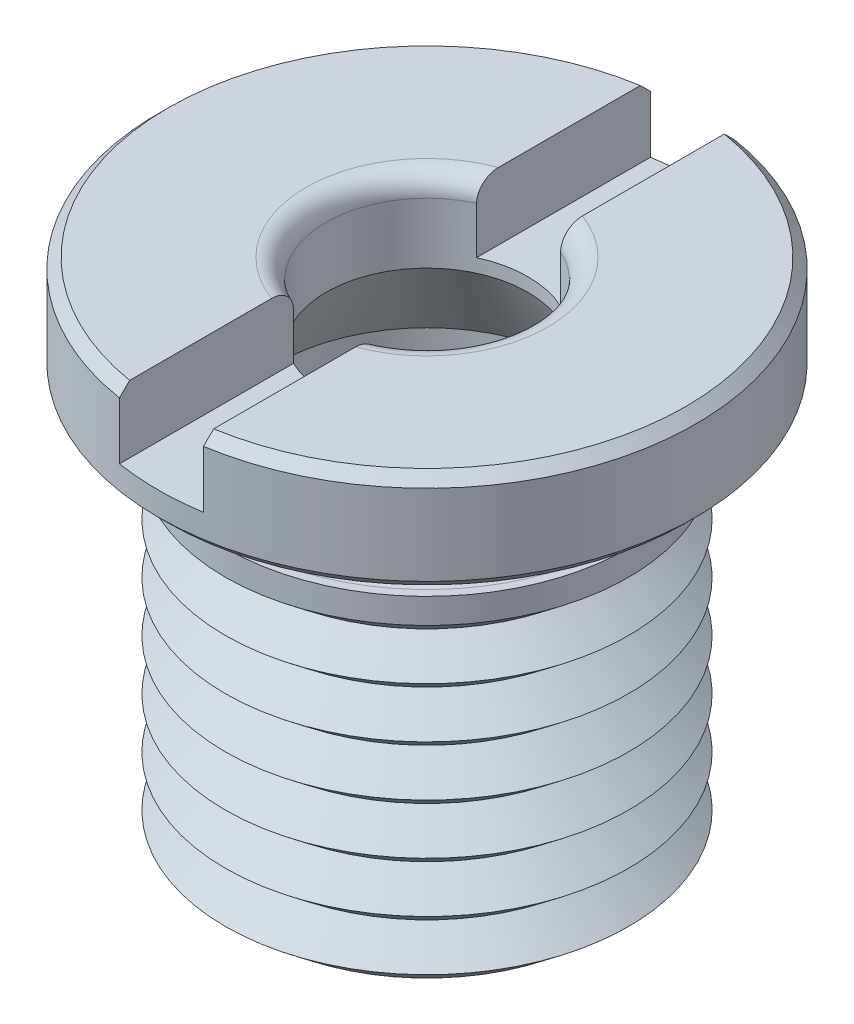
ISO-10303-21;
HEADER;
FILE_DESCRIPTION(('STEP AP214'),'2;1');
FILE_NAME('part.step','',(''),(''),'','','');
FILE_SCHEMA(('AUTOMOTIVE_DESIGN { 1 0 10303 214 1 1 1 1 }'));
ENDSEC;
DATA;
#1=APPLICATION_CONTEXT('core data for automotive mechanical design processes');
#2=APPLICATION_PROTOCOL_DEFINITION('international standard','automotive_design',2000,#1);
#3=PRODUCT_CONTEXT('',#1,'mechanical');
#4=PRODUCT('Part','Part','',(#3));
#5=PRODUCT_RELATED_PRODUCT_CATEGORY('part','',(#4));
#6=PRODUCT_DEFINITION_FORMATION('','',#4);
#7=PRODUCT_DEFINITION_CONTEXT('part definition',#1,'design');
#8=PRODUCT_DEFINITION('design','',#6,#7);
#9=PRODUCT_DEFINITION_SHAPE('','',#8);
#10=(LENGTH_UNIT() NAMED_UNIT(*) SI_UNIT(.MILLI.,.METRE.));
#11=(NAMED_UNIT(*) PLANE_ANGLE_UNIT() SI_UNIT($,.RADIAN.));
#12=(NAMED_UNIT(*) SI_UNIT($,.STERADIAN.) SOLID_ANGLE_UNIT());
#13=UNCERTAINTY_MEASURE_WITH_UNIT(LENGTH_MEASURE(1.E-05),#10,'distance_accuracy_value','');
#14=(GEOMETRIC_REPRESENTATION_CONTEXT(3) GLOBAL_UNCERTAINTY_ASSIGNED_CONTEXT((#13)) GLOBAL_UNIT_ASSIGNED_CONTEXT((#10,
#11,#12)) REPRESENTATION_CONTEXT('',''));
#15=CARTESIAN_POINT('',(0.,0.,0.));
#16=DIRECTION('',(0.,0.,1.));
#17=DIRECTION('',(1.,0.,0.));
#18=AXIS2_PLACEMENT_3D('',#15,#16,#17);
#19=CARTESIAN_POINT('',(0.,14.4,0.));
#20=DIRECTION('',(0.,-1.,0.));
#21=DIRECTION('',(0.,0.,-1.));
#22=AXIS2_PLACEMENT_3D('',#19,#20,#21);
#23=TOROIDAL_SURFACE('',#22,3.6,0.599999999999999);
#24=CARTESIAN_POINT('',(1.25,14.6431833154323,-3.9557079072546));
#25=CARTESIAN_POINT('',(1.25,14.6138321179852,-3.9693536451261));
#26=CARTESIAN_POINT('',(1.25,14.5833271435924,-3.98056553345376));
#27=CARTESIAN_POINT('',(1.25,14.5208478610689,-3.99772547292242));
#28=CARTESIAN_POINT('',(1.25,14.4888722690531,-4.00366882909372));
#29=CARTESIAN_POINT('',(1.25,14.4243714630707,-4.0100730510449));
#30=CARTESIAN_POINT('',(1.25,14.3918462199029,-4.01053362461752));
#31=CARTESIAN_POINT('',(1.25,14.3271928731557,-4.0059539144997));
#32=CARTESIAN_POINT('',(1.25,14.2950646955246,-4.0009146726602));
#33=CARTESIAN_POINT('',(1.25,14.2322700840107,-3.98555292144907));
#34=CARTESIAN_POINT('',(1.25,14.2015971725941,-3.9752568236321));
#35=CARTESIAN_POINT('',(1.25,14.1423741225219,-3.94974377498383));
#36=CARTESIAN_POINT('',(1.25,14.1138241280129,-3.93452649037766));
#37=CARTESIAN_POINT('',(1.25,14.0591177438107,-3.8993674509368));
#38=CARTESIAN_POINT('',(1.25,14.0330098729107,-3.87935030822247));
#39=CARTESIAN_POINT('',(1.25,13.9843720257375,-3.83536493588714));
#40=CARTESIAN_POINT('',(1.25,13.9618425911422,-3.81139610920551));
#41=CARTESIAN_POINT('',(1.25,13.9200645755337,-3.75922974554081));
#42=CARTESIAN_POINT('',(1.25,13.9009740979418,-3.73090569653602));
#43=CARTESIAN_POINT('',(1.25,13.8675549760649,-3.6715787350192));
#44=CARTESIAN_POINT('',(1.25,13.8532273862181,-3.64057523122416));
#45=CARTESIAN_POINT('',(1.25,13.8289726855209,-3.57510371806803));
#46=CARTESIAN_POINT('',(1.25,13.8193044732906,-3.54053981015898));
#47=CARTESIAN_POINT('',(1.25,13.8056096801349,-3.47031269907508));
#48=CARTESIAN_POINT('',(1.25,13.8015845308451,-3.43464921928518));
#49=CARTESIAN_POINT('',(1.25,13.7991244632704,-3.36138519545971));
#50=CARTESIAN_POINT('',(1.25,13.8009718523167,-3.32377503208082));
#51=CARTESIAN_POINT('',(1.25,13.8107758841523,-3.24935537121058));
#52=CARTESIAN_POINT('',(1.25,13.8187338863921,-3.21254605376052));
#53=CARTESIAN_POINT('',(1.25,13.8408582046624,-3.13975111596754));
#54=CARTESIAN_POINT('',(1.25,13.8551857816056,-3.10381429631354));
#55=CARTESIAN_POINT('',(1.25,13.8897709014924,-3.03490427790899));
#56=CARTESIAN_POINT('',(1.25,13.9100287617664,-3.00193123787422));
#57=CARTESIAN_POINT('',(1.25,13.9556387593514,-2.94060081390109));
#58=CARTESIAN_POINT('',(1.25,13.9808954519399,-2.91217269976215));
#59=CARTESIAN_POINT('',(1.25,14.0361377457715,-2.8603451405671));
#60=CARTESIAN_POINT('',(1.25,14.0661212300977,-2.83694345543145));
#61=CARTESIAN_POINT('',(1.25,14.1277817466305,-2.79765709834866));
#62=CARTESIAN_POINT('',(1.25,14.1591983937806,-2.78136459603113));
#63=CARTESIAN_POINT('',(1.25,14.224500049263,-2.75486689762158));
#64=CARTESIAN_POINT('',(1.25,14.2583832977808,-2.7446574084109));
#65=CARTESIAN_POINT('',(1.25,14.3244686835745,-2.73147943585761));
#66=CARTESIAN_POINT('',(1.25,14.3565614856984,-2.72795939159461));
#67=CARTESIAN_POINT('',(1.25,14.4208612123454,-2.72663032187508));
#68=CARTESIAN_POINT('',(1.25,14.4530681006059,-2.72881962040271));
#69=CARTESIAN_POINT('',(1.25,14.5152051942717,-2.73857587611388));
#70=CARTESIAN_POINT('',(1.25,14.5451734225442,-2.74590403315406));
#71=CARTESIAN_POINT('',(1.25,14.6035060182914,-2.76535445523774));
#72=CARTESIAN_POINT('',(1.25,14.6318702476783,-2.77747713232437));
#73=CARTESIAN_POINT('',(1.25,14.6870820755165,-2.80643912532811));
#74=CARTESIAN_POINT('',(1.25,14.7138655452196,-2.82340025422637));
#75=CARTESIAN_POINT('',(1.25,14.7644661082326,-2.86127800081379));
#76=CARTESIAN_POINT('',(1.25,14.7882823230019,-2.88219578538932));
#77=CARTESIAN_POINT('',(1.25,14.8341991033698,-2.92906778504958));
#78=CARTESIAN_POINT('',(1.25,14.8560323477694,-2.9552837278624));
#79=CARTESIAN_POINT('',(1.25,14.8953767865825,-3.01077813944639));
#80=CARTESIAN_POINT('',(1.25,14.9128863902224,-3.0400577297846));
#81=CARTESIAN_POINT('',(1.25,14.9444998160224,-3.10334575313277));
#82=CARTESIAN_POINT('',(1.25,14.9582222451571,-3.13754507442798));
#83=CARTESIAN_POINT('',(1.25,14.9800161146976,-3.2077018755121));
#84=CARTESIAN_POINT('',(1.25,14.9880859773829,-3.24365984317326));
#85=CARTESIAN_POINT('',(1.25,14.9986146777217,-3.31805650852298));
#86=CARTESIAN_POINT('',(1.25,15.0008031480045,-3.35653383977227));
#87=CARTESIAN_POINT('',(1.25,14.9986725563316,-3.43331214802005));
#88=CARTESIAN_POINT('',(1.25,14.9943533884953,-3.471613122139));
#89=CARTESIAN_POINT('',(1.25,14.9792381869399,-3.54678730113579));
#90=CARTESIAN_POINT('',(1.25,14.9684642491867,-3.58366492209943));
#91=CARTESIAN_POINT('',(1.25,14.9406154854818,-3.65497735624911));
#92=CARTESIAN_POINT('',(1.25,14.9235402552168,-3.68941201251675));
#93=CARTESIAN_POINT('',(1.25,14.884267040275,-3.75333865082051));
#94=CARTESIAN_POINT('',(1.25,14.862301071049,-3.78297317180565));
#95=CARTESIAN_POINT('',(1.25,14.8134609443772,-3.83783170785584));
#96=CARTESIAN_POINT('',(1.25,14.7865949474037,-3.86306292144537));
#97=CARTESIAN_POINT('',(1.25,14.7399938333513,-3.8994146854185));
#98=CARTESIAN_POINT('',(1.25,14.7215415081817,-3.91220974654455));
#99=CARTESIAN_POINT('',(1.25,14.6833051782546,-3.93562863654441));
#100=CARTESIAN_POINT('',(1.25,14.663521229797,-3.94625255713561));
#101=CARTESIAN_POINT('',(1.25,14.6431833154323,-3.9557079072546));
#102=B_SPLINE_CURVE_WITH_KNOTS('',3,(#24,#25,#26,#27,#28,#29,#30,#31,#32,#33,#34,#35,#36,#37,
#38,#39,#40,#41,#42,#43,#44,#45,#46,#47,#48,#49,#50,#51,#52,#53,#54,#55,#56,#57,#58,#59,#60,#61,
#62,#63,#64,#65,#66,#67,#68,#69,#70,#71,#72,#73,#74,#75,#76,#77,#78,#79,#80,#81,#82,#83,#84,#85,
#86,#87,#88,#89,#90,#91,#92,#93,#94,#95,#96,#97,#98,#99,#100,#101),.UNSPECIFIED.,.T.,.F.,(4,2,2,
2,2,2,2,2,2,2,2,2,2,2,2,2,2,2,2,2,2,2,2,2,2,2,2,2,2,2,2,2,2,2,2,2,2,2,4),(0.,0.0970243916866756,
0.194135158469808,0.291251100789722,0.388348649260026,0.484963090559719,0.581584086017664,
0.679835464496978,0.778101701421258,0.880119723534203,0.98216031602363,1.08935632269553,
1.19657951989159,1.30903374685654,1.42151299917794,1.53701825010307,1.65252968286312,
1.76601785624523,1.87945534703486,1.98505050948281,2.09057105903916,2.18693315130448,
2.28326695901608,2.37539762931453,2.46753621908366,2.56223761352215,2.65696698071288,
2.75888457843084,2.86083961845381,2.97089956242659,3.08099021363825,3.19606151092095,
3.31113468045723,3.42581616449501,3.54050500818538,3.65061010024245,3.76053347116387,
3.82776606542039,3.89499581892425),.UNSPECIFIED.);
#103=CARTESIAN_POINT('',(1.25,14.4,-2.72717802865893));
#104=VERTEX_POINT('',#103);
#105=CARTESIAN_POINT('',(1.25,15.,-3.37601836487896));
#106=VERTEX_POINT('',#105);
#107=EDGE_CURVE('E287',#104,#106,#102,.T.);
#108=ORIENTED_EDGE('',*,*,#107,.F.);
#109=CARTESIAN_POINT('',(0.,14.4,0.));
#110=DIRECTION('',(0.,-1.,0.));
#111=DIRECTION('',(0.,0.,-1.));
#112=AXIS2_PLACEMENT_3D('',#109,#110,#111);
#113=CIRCLE('',#112,3.);
#114=CARTESIAN_POINT('',(1.25,14.4000000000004,2.7271780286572));
#115=VERTEX_POINT('',#114);
#116=EDGE_CURVE('E183',#104,#115,#113,.T.);
#117=ORIENTED_EDGE('',*,*,#116,.T.);
#118=CARTESIAN_POINT('',(1.25,14.529998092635,2.7428482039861));
#119=CARTESIAN_POINT('',(1.25,14.4999535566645,2.73552202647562));
#120=CARTESIAN_POINT('',(1.25,14.4692770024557,2.73071074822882));
#121=CARTESIAN_POINT('',(1.25,14.4075355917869,2.7263523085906));
#122=CARTESIAN_POINT('',(1.25,14.3764704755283,2.72680888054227));
#123=CARTESIAN_POINT('',(1.25,14.3148894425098,2.73296758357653));
#124=CARTESIAN_POINT('',(1.25,14.284373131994,2.73866578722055));
#125=CARTESIAN_POINT('',(1.25,14.2247168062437,2.75504255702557));
#126=CARTESIAN_POINT('',(1.25,14.1955767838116,2.76572109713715));
#127=CARTESIAN_POINT('',(1.25,14.1390346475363,2.79178349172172));
#128=CARTESIAN_POINT('',(1.25,14.1116598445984,2.80722634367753));
#129=CARTESIAN_POINT('',(1.25,14.0596634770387,2.8421967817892));
#130=CARTESIAN_POINT('',(1.25,14.0350426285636,2.8617254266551));
#131=CARTESIAN_POINT('',(1.25,13.987375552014,2.9057668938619));
#132=CARTESIAN_POINT('',(1.25,13.9645657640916,2.93053537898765));
#133=CARTESIAN_POINT('',(1.25,13.9230465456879,2.98329667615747));
#134=CARTESIAN_POINT('',(1.25,13.9043386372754,3.01129067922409));
#135=CARTESIAN_POINT('',(1.25,13.8699807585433,3.07216558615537));
#136=CARTESIAN_POINT('',(1.25,13.8547066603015,3.10525895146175));
#137=CARTESIAN_POINT('',(1.25,13.8296116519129,3.17345432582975));
#138=CARTESIAN_POINT('',(1.25,13.8197923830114,3.20855693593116));
#139=CARTESIAN_POINT('',(1.25,13.8054521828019,3.28174937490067));
#140=CARTESIAN_POINT('',(1.25,13.8012360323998,3.31989933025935));
#141=CARTESIAN_POINT('',(1.25,13.7992324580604,3.39637302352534));
#142=CARTESIAN_POINT('',(1.25,13.8014456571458,3.43469677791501));
#143=CARTESIAN_POINT('',(1.25,13.8123637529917,3.5105847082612));
#144=CARTESIAN_POINT('',(1.25,13.8210964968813,3.54814491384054));
#145=CARTESIAN_POINT('',(1.25,13.8449786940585,3.62117285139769));
#146=CARTESIAN_POINT('',(1.25,13.8601270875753,3.6566409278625));
#147=CARTESIAN_POINT('',(1.25,13.8958804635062,3.72307644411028));
#148=CARTESIAN_POINT('',(1.25,13.9162695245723,3.75415989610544));
#149=CARTESIAN_POINT('',(1.25,13.9622515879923,3.81220917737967));
#150=CARTESIAN_POINT('',(1.25,13.9878429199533,3.8391763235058));
#151=CARTESIAN_POINT('',(1.25,14.0420299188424,3.88668168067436));
#152=CARTESIAN_POINT('',(1.25,14.0703918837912,3.90748648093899));
#153=CARTESIAN_POINT('',(1.25,14.1303488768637,3.94375296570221));
#154=CARTESIAN_POINT('',(1.25,14.1619428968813,3.95921630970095));
#155=CARTESIAN_POINT('',(1.25,14.2258147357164,3.9836050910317));
#156=CARTESIAN_POINT('',(1.25,14.2579860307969,3.99280995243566));
#157=CARTESIAN_POINT('',(1.25,14.3234353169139,4.00551147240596));
#158=CARTESIAN_POINT('',(1.25,14.3567130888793,4.00900925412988));
#159=CARTESIAN_POINT('',(1.25,14.4224209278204,4.0101526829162));
#160=CARTESIAN_POINT('',(1.25,14.4548482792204,4.00796143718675));
#161=CARTESIAN_POINT('',(1.25,14.5188681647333,3.99814869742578));
#162=CARTESIAN_POINT('',(1.25,14.5504607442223,3.9905274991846));
#163=CARTESIAN_POINT('',(1.25,14.6118488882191,3.97014489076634));
#164=CARTESIAN_POINT('',(1.25,14.6416487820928,3.95739648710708));
#165=CARTESIAN_POINT('',(1.25,14.6987497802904,3.9271839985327));
#166=CARTESIAN_POINT('',(1.25,14.7260506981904,3.90971956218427));
#167=CARTESIAN_POINT('',(1.25,14.7780629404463,3.87018271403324));
#168=CARTESIAN_POINT('',(1.25,14.8027017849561,3.8480150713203));
#169=CARTESIAN_POINT('',(1.25,14.8480909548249,3.80000816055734));
#170=CARTESIAN_POINT('',(1.25,14.8688406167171,3.77416826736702));
#171=CARTESIAN_POINT('',(1.25,14.9068101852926,3.71840277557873));
#172=CARTESIAN_POINT('',(1.25,14.9238444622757,3.68835087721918));
#173=CARTESIAN_POINT('',(1.25,14.9529087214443,3.62592018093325));
#174=CARTESIAN_POINT('',(1.25,14.9649375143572,3.59354083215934));
#175=CARTESIAN_POINT('',(1.25,14.9842994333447,3.52559549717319));
#176=CARTESIAN_POINT('',(1.25,14.9913581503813,3.4899512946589));
#177=CARTESIAN_POINT('',(1.25,14.9996771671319,3.4179926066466));
#178=CARTESIAN_POINT('',(1.25,15.0009360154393,3.38167795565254));
#179=CARTESIAN_POINT('',(1.25,14.997624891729,3.3076524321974));
#180=CARTESIAN_POINT('',(1.25,14.9927865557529,3.26995338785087));
#181=CARTESIAN_POINT('',(1.25,14.9769721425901,3.19586053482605));
#182=CARTESIAN_POINT('',(1.25,14.9659950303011,3.15946694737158));
#183=CARTESIAN_POINT('',(1.25,14.9378968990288,3.08836593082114));
#184=CARTESIAN_POINT('',(1.25,14.9206689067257,3.05370061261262));
#185=CARTESIAN_POINT('',(1.25,14.8804596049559,2.98785600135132));
#186=CARTESIAN_POINT('',(1.25,14.8574769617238,2.95667751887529));
#187=CARTESIAN_POINT('',(1.25,14.8070450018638,2.89981666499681));
#188=CARTESIAN_POINT('',(1.25,14.7797500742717,2.87399765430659));
#189=CARTESIAN_POINT('',(1.25,14.7209206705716,2.82781068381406));
#190=CARTESIAN_POINT('',(1.25,14.6893947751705,2.80743193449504));
#191=CARTESIAN_POINT('',(1.25,14.6362233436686,2.77990973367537));
#192=CARTESIAN_POINT('',(1.25,14.6156144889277,2.77072188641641));
#193=CARTESIAN_POINT('',(1.25,14.573448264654,2.75486044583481));
#194=CARTESIAN_POINT('',(1.25,14.5518909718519,2.74818664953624));
#195=CARTESIAN_POINT('',(1.25,14.529998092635,2.7428482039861));
#196=B_SPLINE_CURVE_WITH_KNOTS('',3,(#118,#119,#120,#121,#122,#123,#124,#125,#126,#127,#128,
#129,#130,#131,#132,#133,#134,#135,#136,#137,#138,#139,#140,#141,#142,#143,#144,#145,#146,#147,
#148,#149,#150,#151,#152,#153,#154,#155,#156,#157,#158,#159,#160,#161,#162,#163,#164,#165,#166,
#167,#168,#169,#170,#171,#172,#173,#174,#175,#176,#177,#178,#179,#180,#181,#182,#183,#184,#185,
#186,#187,#188,#189,#190,#191,#192,#193,#194,#195),.UNSPECIFIED.,.T.,.F.,(4,2,2,2,2,2,2,2,2,2,2,
2,2,2,2,2,2,2,2,2,2,2,2,2,2,2,2,2,2,2,2,2,2,2,2,2,2,2,4),(0.,0.0926930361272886,
0.185451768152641,0.278141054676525,0.370829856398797,0.46471593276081,0.558626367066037,
0.659214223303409,0.759839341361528,0.868704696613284,0.977602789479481,1.09221035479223,
1.20682902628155,1.32194009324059,1.43703215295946,1.54798350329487,1.65889928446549,
1.76388645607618,1.86884098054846,1.96873207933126,2.06860351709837,2.1656434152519,
2.26267802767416,2.35946802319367,2.45626523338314,2.55525033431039,2.65425230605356,
2.75742695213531,2.86062609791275,2.96915180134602,3.07770466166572,3.19120665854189,
3.30472779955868,3.42029112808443,3.53588126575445,3.6480095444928,3.75991376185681,
3.82746286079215,3.89500650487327),.UNSPECIFIED.);
#197=CARTESIAN_POINT('',(1.25,15.,3.37601836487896));
#198=VERTEX_POINT('',#197);
#199=EDGE_CURVE('E274',#198,#115,#196,.T.);
#200=ORIENTED_EDGE('',*,*,#199,.F.);
#201=CARTESIAN_POINT('',(0.,15.,0.));
#202=DIRECTION('',(0.,-1.,0.));
#203=DIRECTION('',(0.,0.,-1.));
#204=AXIS2_PLACEMENT_3D('',#201,#202,#203);
#205=CIRCLE('',#204,3.6);
#206=EDGE_CURVE('E178',#106,#198,#205,.T.);
#207=ORIENTED_EDGE('',*,*,#206,.F.);
#208=EDGE_LOOP('',(#108,#117,#200,#207));
#209=FACE_BOUND('',#208,.T.);
#210=ADVANCED_FACE('F39',(#209),#23,.T.);
#211=CARTESIAN_POINT('',(7.7,15.,0.));
#212=DIRECTION('',(0.,1.,0.));
#213=DIRECTION('',(0.,0.,1.));
#214=AXIS2_PLACEMENT_3D('',#211,#212,#213);
#215=PLANE('',#214);
#216=DIRECTION('',(0.,0.,-1.));
#217=VECTOR('',#216,1.);
#218=CARTESIAN_POINT('',(1.25,15.,8.));
#219=LINE('',#218,#217);
#220=CARTESIAN_POINT('',(1.25,15.,7.59786154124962));
#221=VERTEX_POINT('',#220);
#222=EDGE_CURVE('E365',#221,#198,#219,.T.);
#223=ORIENTED_EDGE('',*,*,#222,.F.);
#224=CARTESIAN_POINT('',(0.,15.,0.));
#225=DIRECTION('',(0.,-1.,0.));
#226=DIRECTION('',(0.,0.,-1.));
#227=AXIS2_PLACEMENT_3D('',#224,#225,#226);
#228=CIRCLE('',#227,7.7);
#229=CARTESIAN_POINT('',(1.25,15.,-7.59786154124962));
#230=VERTEX_POINT('',#229);
#231=EDGE_CURVE('E167',#230,#221,#228,.T.);
#232=ORIENTED_EDGE('',*,*,#231,.F.);
#233=EDGE_CURVE('E363',#106,#230,#219,.T.);
#234=ORIENTED_EDGE('',*,*,#233,.F.);
#235=ORIENTED_EDGE('',*,*,#206,.T.);
#236=EDGE_LOOP('',(#223,#232,#234,#235));
#237=FACE_BOUND('',#236,.T.);
#238=ADVANCED_FACE('F341',(#237),#215,.T.);
#239=CARTESIAN_POINT('',(0.,14.7,0.));
#240=DIRECTION('',(0.,-1.,0.));
#241=DIRECTION('',(0.,0.,-1.));
#242=AXIS2_PLACEMENT_3D('',#239,#240,#241);
#243=CONICAL_SURFACE('',#242,8.,0.785398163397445);
#244=CARTESIAN_POINT('',(1.25,5.09811264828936,17.5574468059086));
#245=CARTESIAN_POINT('',(1.25,5.70610155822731,16.9479065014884));
#246=CARTESIAN_POINT('',(1.25,6.31402225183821,16.3382981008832));
#247=CARTESIAN_POINT('',(1.25,7.52965506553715,15.1188394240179));
#248=CARTESIAN_POINT('',(1.25,8.13736717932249,14.5089891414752));
#249=CARTESIAN_POINT('',(1.25,9.35286941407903,13.2885807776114));
#250=CARTESIAN_POINT('',(1.25,9.96065933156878,12.6780224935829));
#251=CARTESIAN_POINT('',(1.25,11.1757391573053,11.4564416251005));
#252=CARTESIAN_POINT('',(1.25,11.7830290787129,10.8454190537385));
#253=CARTESIAN_POINT('',(1.25,12.9940460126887,9.62541460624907));
#254=CARTESIAN_POINT('',(1.25,13.5977765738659,9.01643625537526));
#255=CARTESIAN_POINT('',(1.25,14.5023510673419,8.10190768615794));
#256=CARTESIAN_POINT('',(1.25,14.8037182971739,7.79687516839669));
#257=CARTESIAN_POINT('',(1.25,15.4059512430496,7.18632006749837));
#258=CARTESIAN_POINT('',(1.25,15.7068169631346,6.88079748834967));
#259=CARTESIAN_POINT('',(1.25,16.3076957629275,6.26915572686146));
#260=CARTESIAN_POINT('',(1.25,16.6077091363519,5.96303683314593));
#261=CARTESIAN_POINT('',(1.25,17.2066202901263,5.34968886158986));
#262=CARTESIAN_POINT('',(1.25,17.5055180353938,5.04245974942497));
#263=CARTESIAN_POINT('',(1.25,17.9524056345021,4.58024752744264));
#264=CARTESIAN_POINT('',(1.25,18.1011144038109,4.42595978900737));
#265=CARTESIAN_POINT('',(1.25,18.3978758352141,4.11675492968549));
#266=CARTESIAN_POINT('',(1.25,18.5459284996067,3.961837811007));
#267=CARTESIAN_POINT('',(1.25,18.8411138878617,3.65114384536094));
#268=CARTESIAN_POINT('',(1.25,18.9882466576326,3.49536704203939));
#269=CARTESIAN_POINT('',(1.25,19.2811902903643,3.18257646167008));
#270=CARTESIAN_POINT('',(1.25,19.4270011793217,3.02556270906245));
#271=CARTESIAN_POINT('',(1.25,19.6113127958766,2.82449624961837));
#272=CARTESIAN_POINT('',(1.25,19.6507595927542,2.7813106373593));
#273=CARTESIAN_POINT('',(1.25,19.7294767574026,2.69477869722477));
#274=CARTESIAN_POINT('',(1.25,19.7687471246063,2.65143236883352));
#275=CARTESIAN_POINT('',(1.25,19.8862614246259,2.52111862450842));
#276=CARTESIAN_POINT('',(1.25,19.9642053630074,2.43387992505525));
#277=CARTESIAN_POINT('',(1.25,20.1191792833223,2.25828363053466));
#278=CARTESIAN_POINT('',(1.25,20.1962071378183,2.16992415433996));
#279=CARTESIAN_POINT('',(1.25,20.3487798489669,1.99194458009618));
#280=CARTESIAN_POINT('',(1.25,20.424324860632,1.90232461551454));
#281=CARTESIAN_POINT('',(1.25,20.5637312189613,1.73295981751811));
#282=CARTESIAN_POINT('',(1.25,20.6278469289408,1.65342512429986));
#283=CARTESIAN_POINT('',(1.25,20.7537877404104,1.49256596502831));
#284=CARTESIAN_POINT('',(1.25,20.8156131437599,1.41124173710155));
#285=CARTESIAN_POINT('',(1.25,20.9358293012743,1.24619541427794));
#286=CARTESIAN_POINT('',(1.25,20.9942234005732,1.16247577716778));
#287=CARTESIAN_POINT('',(1.25,21.1057491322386,0.991632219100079));
#288=CARTESIAN_POINT('',(1.25,21.158885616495,0.904511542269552));
#289=CARTESIAN_POINT('',(1.25,21.2510675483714,0.73574779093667));
#290=CARTESIAN_POINT('',(1.25,21.2910291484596,0.654614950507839));
#291=CARTESIAN_POINT('',(1.25,21.360287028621,0.487866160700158));
#292=CARTESIAN_POINT('',(1.25,21.3896104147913,0.40226225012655));
#293=CARTESIAN_POINT('',(1.25,21.4197475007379,0.278856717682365));
#294=CARTESIAN_POINT('',(1.25,21.4271738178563,0.242655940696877));
#295=CARTESIAN_POINT('',(1.25,21.4390345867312,0.16977569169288));
#296=CARTESIAN_POINT('',(1.25,21.4434704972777,0.133096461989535));
#297=CARTESIAN_POINT('',(1.25,21.4491197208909,0.0595270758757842));
#298=CARTESIAN_POINT('',(1.25,21.4503366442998,0.0226372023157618));
#299=CARTESIAN_POINT('',(1.25,21.4495013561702,-0.0510981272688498));
#300=CARTESIAN_POINT('',(1.25,21.4474490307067,-0.0879435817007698));
#301=CARTESIAN_POINT('',(1.25,21.4365362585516,-0.197727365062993));
#302=CARTESIAN_POINT('',(1.25,21.4229436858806,-0.270237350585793));
#303=CARTESIAN_POINT('',(1.25,21.3948795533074,-0.37688228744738));
#304=CARTESIAN_POINT('',(1.25,21.3842261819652,-0.412123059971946));
#305=CARTESIAN_POINT('',(1.25,21.3607350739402,-0.481873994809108));
#306=CARTESIAN_POINT('',(1.25,21.3478974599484,-0.516384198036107));
#307=CARTESIAN_POINT('',(1.25,21.3142289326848,-0.599927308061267));
#308=CARTESIAN_POINT('',(1.25,21.2923911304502,-0.648551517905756));
#309=CARTESIAN_POINT('',(1.25,21.2457518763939,-0.744368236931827));
#310=CARTESIAN_POINT('',(1.25,21.2209487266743,-0.791559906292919));
#311=CARTESIAN_POINT('',(1.25,21.1430765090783,-0.931429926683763));
#312=CARTESIAN_POINT('',(1.25,21.0866267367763,-1.02221540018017));
#313=CARTESIAN_POINT('',(1.25,20.967851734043,-1.20096117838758));
#314=CARTESIAN_POINT('',(1.25,20.9054769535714,-1.28888755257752));
#315=CARTESIAN_POINT('',(1.25,20.8093439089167,-1.41877207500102));
#316=CARTESIAN_POINT('',(1.25,20.7768923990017,-1.46170624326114));
#317=CARTESIAN_POINT('',(1.25,20.7112738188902,-1.54702165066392));
#318=CARTESIAN_POINT('',(1.25,20.6781067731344,-1.58940290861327));
#319=CARTESIAN_POINT('',(1.25,20.5680594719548,-1.72804302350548));
#320=CARTESIAN_POINT('',(1.25,20.489947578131,-1.82332355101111));
#321=CARTESIAN_POINT('',(1.25,20.3317078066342,-2.0121998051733));
#322=CARTESIAN_POINT('',(1.25,20.2515797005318,-2.10579533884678));
#323=CARTESIAN_POINT('',(1.25,20.0898882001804,-2.29178888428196));
#324=CARTESIAN_POINT('',(1.25,20.008324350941,-2.3841864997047));
#325=CARTESIAN_POINT('',(1.25,19.844170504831,-2.5680668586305));
#326=CARTESIAN_POINT('',(1.25,19.7615804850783,-2.65954958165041));
#327=CARTESIAN_POINT('',(1.25,19.5124490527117,-2.93321359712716));
#328=CARTESIAN_POINT('',(1.25,19.3447692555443,-3.11435746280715));
#329=CARTESIAN_POINT('',(1.25,19.0076405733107,-3.47491618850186));
#330=CARTESIAN_POINT('',(1.25,18.8381920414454,-3.65433138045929));
#331=CARTESIAN_POINT('',(1.25,18.4992884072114,-4.01079886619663));
#332=CARTESIAN_POINT('',(1.25,18.329841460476,-4.18785891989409));
#333=CARTESIAN_POINT('',(1.25,17.9901382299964,-4.54121713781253));
#334=CARTESIAN_POINT('',(1.25,17.8198819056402,-4.71751526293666));
#335=CARTESIAN_POINT('',(1.25,17.4789197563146,-5.06942541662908));
#336=CARTESIAN_POINT('',(1.25,17.3082143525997,-5.24503785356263));
#337=CARTESIAN_POINT('',(1.25,16.9663782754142,-5.59584260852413));
#338=CARTESIAN_POINT('',(1.25,16.7952476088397,-5.77103493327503));
#339=CARTESIAN_POINT('',(1.25,16.1495622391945,-6.4308510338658));
#340=CARTESIAN_POINT('',(1.25,15.6739523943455,-6.9144419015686));
#341=CARTESIAN_POINT('',(1.25,14.7214780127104,-7.88039194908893));
#342=CARTESIAN_POINT('',(1.25,14.2446134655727,-8.36275111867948));
#343=CARTESIAN_POINT('',(1.25,13.2899757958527,-9.32687580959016));
#344=CARTESIAN_POINT('',(1.25,12.8122024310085,-9.8086410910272));
#345=CARTESIAN_POINT('',(1.25,11.8561760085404,-10.7716925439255));
#346=CARTESIAN_POINT('',(1.25,11.3779229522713,-11.2529787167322));
#347=CARTESIAN_POINT('',(1.25,10.4164275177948,-12.219913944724));
#348=CARTESIAN_POINT('',(1.25,9.93318193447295,-12.705559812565));
#349=CARTESIAN_POINT('',(1.25,8.96645454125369,-13.6766172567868));
#350=CARTESIAN_POINT('',(1.25,8.48297273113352,-14.1620288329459));
#351=CARTESIAN_POINT('',(1.25,7.51600145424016,-15.132515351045));
#352=CARTESIAN_POINT('',(1.25,7.03251204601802,-15.6175903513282));
#353=CARTESIAN_POINT('',(1.25,6.06540141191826,-16.5876079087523));
#354=CARTESIAN_POINT('',(1.25,5.58178018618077,-17.0725504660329));
#355=CARTESIAN_POINT('',(1.25,5.09811264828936,-17.5574468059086));
#356=B_SPLINE_CURVE_WITH_KNOTS('',3,(#244,#245,#246,#247,#248,#249,#250,#251,#252,#253,#254,
#255,#256,#257,#258,#259,#260,#261,#262,#263,#264,#265,#266,#267,#268,#269,#270,#271,#272,#273,
#274,#275,#276,#277,#278,#279,#280,#281,#282,#283,#284,#285,#286,#287,#288,#289,#290,#291,#292,
#293,#294,#295,#296,#297,#298,#299,#300,#301,#302,#303,#304,#305,#306,#307,#308,#309,#310,#311,
#312,#313,#314,#315,#316,#317,#318,#319,#320,#321,#322,#323,#324,#325,#326,#327,#328,#329,#330,
#331,#332,#333,#334,#335,#336,#337,#338,#339,#340,#341,#342,#343,#344,#345,#346,#347,#348,#349,
#350,#351,#352,#353,#354,#355),.UNSPECIFIED.,.F.,.F.,(4,2,2,2,2,2,2,2,2,2,2,2,2,2,2,2,2,2,2,2,2,
2,2,2,2,2,2,2,2,2,2,2,2,2,2,2,2,2,2,2,2,2,2,2,2,2,2,2,2,2,2,2,2,2,2,4),(0.,2.58277163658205,
5.16561544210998,7.75012873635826,10.3345716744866,12.9071383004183,14.1935295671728,
15.4799104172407,16.7657750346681,18.051679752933,18.6945400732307,19.3373981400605,
19.9802238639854,20.623036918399,20.7985056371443,20.9739749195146,21.3249276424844,
21.6765787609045,22.0281929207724,22.3346442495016,22.6410550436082,22.9471619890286,
23.2529837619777,23.5238896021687,23.7941002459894,23.9048588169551,24.0155633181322,
24.1261436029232,24.2367277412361,24.4569341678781,24.5673336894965,24.6777270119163,
24.8374992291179,24.9973633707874,25.3177036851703,25.641009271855,25.8024581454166,
25.9639015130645,26.3334722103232,26.7030849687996,27.0728170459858,27.442557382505,
28.1830502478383,28.9233979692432,29.6586237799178,30.3938868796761,31.1286107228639,
31.8633227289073,33.8981593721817,35.9330128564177,37.9685186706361,40.0040187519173,
42.059354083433,44.1146913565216,46.1693294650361,48.2239653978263),.UNSPECIFIED.);
#357=CARTESIAN_POINT('',(1.25,14.7,7.90174031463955));
#358=VERTEX_POINT('',#357);
#359=EDGE_CURVE('E280',#358,#221,#356,.T.);
#360=ORIENTED_EDGE('',*,*,#359,.F.);
#361=CARTESIAN_POINT('',(0.,14.7,0.));
#362=DIRECTION('',(0.,-1.,0.));
#363=DIRECTION('',(0.,0.,-1.));
#364=AXIS2_PLACEMENT_3D('',#361,#362,#363);
#365=CIRCLE('',#364,8.);
#366=CARTESIAN_POINT('',(1.25,14.7,-7.90174031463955));
#367=VERTEX_POINT('',#366);
#368=EDGE_CURVE('E155',#367,#358,#365,.T.);
#369=ORIENTED_EDGE('',*,*,#368,.F.);
#370=EDGE_CURVE('E281',#230,#367,#356,.T.);
#371=ORIENTED_EDGE('',*,*,#370,.F.);
#372=ORIENTED_EDGE('',*,*,#231,.T.);
#373=EDGE_LOOP('',(#360,#369,#371,#372));
#374=FACE_BOUND('',#373,.T.);
#375=ADVANCED_FACE('F339',(#374),#243,.T.);
#376=CARTESIAN_POINT('',(0.,0.,0.));
#377=DIRECTION('',(0.,-1.,0.));
#378=DIRECTION('',(0.,0.,-1.));
#379=AXIS2_PLACEMENT_3D('',#376,#377,#378);
#380=CYLINDRICAL_SURFACE('',#379,4.5);
#381=CARTESIAN_POINT('',(0.,0.,0.));
#382=DIRECTION('',(0.,-1.,0.));
#383=DIRECTION('',(0.,0.,-1.));
#384=AXIS2_PLACEMENT_3D('',#381,#382,#383);
#385=CIRCLE('',#384,4.5);
#386=CARTESIAN_POINT('',(0.,0.,-4.5));
#387=VERTEX_POINT('',#386);
#388=EDGE_CURVE('E295',#387,#387,#385,.T.);
#389=ORIENTED_EDGE('',*,*,#388,.T.);
#390=EDGE_LOOP('',(#389));
#391=FACE_BOUND('',#390,.T.);
#392=CARTESIAN_POINT('',(0.,10.,0.));
#393=DIRECTION('',(0.,-1.,0.));
#394=DIRECTION('',(0.,0.,-1.));
#395=AXIS2_PLACEMENT_3D('',#392,#393,#394);
#396=CIRCLE('',#395,4.5);
#397=CARTESIAN_POINT('',(0.,10.,-4.5));
#398=VERTEX_POINT('',#397);
#399=EDGE_CURVE('E191',#398,#398,#396,.T.);
#400=ORIENTED_EDGE('',*,*,#399,.F.);
#401=EDGE_LOOP('',(#400));
#402=FACE_BOUND('',#401,.T.);
#403=ADVANCED_FACE('F41',(#391,#402),#380,.F.);
#404=CARTESIAN_POINT('',(0.,12.5980762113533,0.));
#405=DIRECTION('',(0.,-1.,0.));
#406=DIRECTION('',(0.,0.,-1.));
#407=AXIS2_PLACEMENT_3D('',#404,#405,#406);
#408=CONICAL_SURFACE('',#407,3.,0.523598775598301);
#409=ORIENTED_EDGE('',*,*,#399,.T.);
#410=EDGE_LOOP('',(#409));
#411=FACE_BOUND('',#410,.T.);
#412=CARTESIAN_POINT('',(0.,12.5980762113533,0.));
#413=DIRECTION('',(0.,-1.,0.));
#414=DIRECTION('',(0.,0.,-1.));
#415=AXIS2_PLACEMENT_3D('',#412,#413,#414);
#416=CIRCLE('',#415,3.);
#417=CARTESIAN_POINT('',(0.,12.5980762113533,-3.));
#418=VERTEX_POINT('',#417);
#419=EDGE_CURVE('E187',#418,#418,#416,.T.);
#420=ORIENTED_EDGE('',*,*,#419,.F.);
#421=EDGE_LOOP('',(#420));
#422=FACE_BOUND('',#421,.T.);
#423=ADVANCED_FACE('F796',(#411,#422),#408,.F.);
#424=CARTESIAN_POINT('',(0.,0.,0.));
#425=DIRECTION('',(0.,-1.,0.));
#426=DIRECTION('',(0.,0.,-1.));
#427=AXIS2_PLACEMENT_3D('',#424,#425,#426);
#428=CYLINDRICAL_SURFACE('',#427,3.);
#429=DIRECTION('',(0.,-1.,0.));
#430=VECTOR('',#429,1.);
#431=CARTESIAN_POINT('',(1.25,0.,2.72717802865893));
#432=LINE('',#431,#430);
#433=CARTESIAN_POINT('',(1.25,13.,2.72717802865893));
#434=VERTEX_POINT('',#433);
#435=EDGE_CURVE('E147',#115,#434,#432,.T.);
#436=ORIENTED_EDGE('',*,*,#435,.F.);
#437=ORIENTED_EDGE('',*,*,#116,.F.);
#438=DIRECTION('',(0.,-1.,0.));
#439=VECTOR('',#438,1.);
#440=CARTESIAN_POINT('',(1.25,0.,-2.72717802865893));
#441=LINE('',#440,#439);
#442=CARTESIAN_POINT('',(1.25,13.,-2.72717802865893));
#443=VERTEX_POINT('',#442);
#444=EDGE_CURVE('E62',#443,#104,#441,.F.);
#445=ORIENTED_EDGE('',*,*,#444,.F.);
#446=CARTESIAN_POINT('',(0.,13.,0.));
#447=DIRECTION('',(0.,-1.,0.));
#448=DIRECTION('',(0.,0.,-1.));
#449=AXIS2_PLACEMENT_3D('',#446,#447,#448);
#450=CIRCLE('',#449,3.);
#451=CARTESIAN_POINT('',(-1.25,13.,-2.72717802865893));
#452=VERTEX_POINT('',#451);
#453=EDGE_CURVE('E232',#452,#443,#450,.T.);
#454=ORIENTED_EDGE('',*,*,#453,.F.);
#455=DIRECTION('',(0.,-1.,0.));
#456=VECTOR('',#455,1.);
#457=CARTESIAN_POINT('',(-1.25,0.,-2.72717802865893));
#458=LINE('',#457,#456);
#459=CARTESIAN_POINT('',(-1.25,14.4,-2.72717802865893));
#460=VERTEX_POINT('',#459);
#461=EDGE_CURVE('E260',#460,#452,#458,.T.);
#462=ORIENTED_EDGE('',*,*,#461,.F.);
#463=CARTESIAN_POINT('',(-1.25,14.4,2.72717802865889));
#464=VERTEX_POINT('',#463);
#465=EDGE_CURVE('E182',#464,#460,#113,.T.);
#466=ORIENTED_EDGE('',*,*,#465,.F.);
#467=DIRECTION('',(0.,-1.,0.));
#468=VECTOR('',#467,1.);
#469=CARTESIAN_POINT('',(-1.25,0.,2.72717802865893));
#470=LINE('',#469,#468);
#471=CARTESIAN_POINT('',(-1.25,13.,2.72717802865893));
#472=VERTEX_POINT('',#471);
#473=EDGE_CURVE('E221',#472,#464,#470,.F.);
#474=ORIENTED_EDGE('',*,*,#473,.F.);
#475=EDGE_CURVE('E224',#434,#472,#450,.T.);
#476=ORIENTED_EDGE('',*,*,#475,.F.);
#477=EDGE_LOOP('',(#436,#437,#445,#454,#462,#466,#474,#476));
#478=FACE_BOUND('',#477,.T.);
#479=ORIENTED_EDGE('',*,*,#419,.T.);
#480=EDGE_LOOP('',(#479));
#481=FACE_BOUND('',#480,.T.);
#482=ADVANCED_FACE('F267',(#478,#481),#428,.F.);
#483=CARTESIAN_POINT('',(-1.25,14.6431833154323,-3.9557079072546));
#484=CARTESIAN_POINT('',(-1.25,14.6739335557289,-3.94140809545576));
#485=CARTESIAN_POINT('',(-1.25,14.7034657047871,-3.92441284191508));
#486=CARTESIAN_POINT('',(-1.25,14.7592367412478,-3.88562990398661));
#487=CARTESIAN_POINT('',(-1.25,14.7854699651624,-3.86383415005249));
#488=CARTESIAN_POINT('',(-1.25,14.833884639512,-3.81624338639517));
#489=CARTESIAN_POINT('',(-1.25,14.8560757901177,-3.79045823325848));
#490=CARTESIAN_POINT('',(-1.25,14.8959825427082,-3.73565219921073));
#491=CARTESIAN_POINT('',(-1.25,14.9136992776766,-3.70663214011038));
#492=CARTESIAN_POINT('',(-1.25,14.9448851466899,-3.64507751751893));
#493=CARTESIAN_POINT('',(-1.25,14.9581787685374,-3.61245413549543));
#494=CARTESIAN_POINT('',(-1.25,14.9794028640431,-3.54550695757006));
#495=CARTESIAN_POINT('',(-1.25,14.98733176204,-3.51118266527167));
#496=CARTESIAN_POINT('',(-1.25,14.9980087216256,-3.43992097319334));
#497=CARTESIAN_POINT('',(-1.25,15.0004678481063,-3.40294020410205));
#498=CARTESIAN_POINT('',(-1.25,14.9993851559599,-3.32906468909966));
#499=CARTESIAN_POINT('',(-1.25,14.9958418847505,-3.29216996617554));
#500=CARTESIAN_POINT('',(-1.25,14.982636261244,-3.2180629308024));
#501=CARTESIAN_POINT('',(-1.25,14.9727502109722,-3.18089026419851));
#502=CARTESIAN_POINT('',(-1.25,14.9468879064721,-3.10871783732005));
#503=CARTESIAN_POINT('',(-1.25,14.9309107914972,-3.07371838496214));
#504=CARTESIAN_POINT('',(-1.25,14.8931904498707,-3.00693975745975));
#505=CARTESIAN_POINT('',(-1.25,14.8714439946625,-2.97516239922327));
#506=CARTESIAN_POINT('',(-1.25,14.8226546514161,-2.91595806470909));
#507=CARTESIAN_POINT('',(-1.25,14.7956130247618,-2.8885300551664));
#508=CARTESIAN_POINT('',(-1.25,14.7384316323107,-2.8404466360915));
#509=CARTESIAN_POINT('',(-1.25,14.7085266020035,-2.81951287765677));
#510=CARTESIAN_POINT('',(-1.25,14.6453627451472,-2.78353032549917));
#511=CARTESIAN_POINT('',(-1.25,14.6121063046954,-2.76847738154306));
#512=CARTESIAN_POINT('',(-1.25,14.5463188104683,-2.74607572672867));
#513=CARTESIAN_POINT('',(-1.25,14.5139772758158,-2.73816977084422));
#514=CARTESIAN_POINT('',(-1.25,14.4484019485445,-2.72832507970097));
#515=CARTESIAN_POINT('',(-1.25,14.4151685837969,-2.72638353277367));
#516=CARTESIAN_POINT('',(-1.25,14.3510726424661,-2.72849290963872));
#517=CARTESIAN_POINT('',(-1.25,14.3201967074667,-2.73216155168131));
#518=CARTESIAN_POINT('',(-1.25,14.2595014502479,-2.74462220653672));
#519=CARTESIAN_POINT('',(-1.25,14.2296821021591,-2.75341409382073));
#520=CARTESIAN_POINT('',(-1.25,14.1718057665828,-2.77577107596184));
#521=CARTESIAN_POINT('',(-1.25,14.1437538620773,-2.78934925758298));
#522=CARTESIAN_POINT('',(-1.25,14.0901421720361,-2.82075072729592));
#523=CARTESIAN_POINT('',(-1.25,14.0645829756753,-2.83857501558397));
#524=CARTESIAN_POINT('',(-1.25,14.0149298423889,-2.87912900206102));
#525=CARTESIAN_POINT('',(-1.25,13.9910318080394,-2.90209820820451));
#526=CARTESIAN_POINT('',(-1.25,13.9470666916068,-2.95144611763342));
#527=CARTESIAN_POINT('',(-1.25,13.9270009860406,-2.97782604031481));
#528=CARTESIAN_POINT('',(-1.25,13.8895328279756,-3.0355994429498));
#529=CARTESIAN_POINT('',(-1.25,13.8724917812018,-3.06722753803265));
#530=CARTESIAN_POINT('',(-1.25,13.8436088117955,-3.13277583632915));
#531=CARTESIAN_POINT('',(-1.25,13.8317685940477,-3.16669678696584));
#532=CARTESIAN_POINT('',(-1.25,13.8129663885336,-3.23807417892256));
#533=CARTESIAN_POINT('',(-1.25,13.806343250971,-3.27562032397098));
#534=CARTESIAN_POINT('',(-1.25,13.7993940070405,-3.35129568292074));
#535=CARTESIAN_POINT('',(-1.25,13.7990688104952,-3.38942498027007));
#536=CARTESIAN_POINT('',(-1.25,13.8048413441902,-3.46573516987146));
#537=CARTESIAN_POINT('',(-1.25,13.8110282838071,-3.50390943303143));
#538=CARTESIAN_POINT('',(-1.25,13.8299198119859,-3.57861596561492));
#539=CARTESIAN_POINT('',(-1.25,13.8426236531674,-3.61514842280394));
#540=CARTESIAN_POINT('',(-1.25,13.8738534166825,-3.68433900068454));
#541=CARTESIAN_POINT('',(-1.25,13.8921956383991,-3.71707985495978));
#542=CARTESIAN_POINT('',(-1.25,13.9344025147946,-3.77878940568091));
#543=CARTESIAN_POINT('',(-1.25,13.9582654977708,-3.80775923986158));
#544=CARTESIAN_POINT('',(-1.25,14.0095091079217,-3.85948097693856));
#545=CARTESIAN_POINT('',(-1.25,14.036642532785,-3.88247774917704));
#546=CARTESIAN_POINT('',(-1.25,14.0945572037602,-3.92329542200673));
#547=CARTESIAN_POINT('',(-1.25,14.1253371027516,-3.94111822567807));
#548=CARTESIAN_POINT('',(-1.25,14.1879744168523,-3.97014937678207));
#549=CARTESIAN_POINT('',(-1.25,14.2196975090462,-3.98164791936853));
#550=CARTESIAN_POINT('',(-1.25,14.2846699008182,-3.99895367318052));
#551=CARTESIAN_POINT('',(-1.25,14.3179192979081,-4.00476052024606));
#552=CARTESIAN_POINT('',(-1.25,14.3838259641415,-4.01037095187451));
#553=CARTESIAN_POINT('',(-1.25,14.4164674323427,-4.01036324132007));
#554=CARTESIAN_POINT('',(-1.25,14.4812439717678,-4.00481437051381));
#555=CARTESIAN_POINT('',(-1.25,14.5133797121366,-3.9992812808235));
#556=CARTESIAN_POINT('',(-1.25,14.5616860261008,-3.98669632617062));
#557=CARTESIAN_POINT('',(-1.25,14.5783699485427,-3.98152877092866));
#558=CARTESIAN_POINT('',(-1.25,14.6112045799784,-3.9697147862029));
#559=CARTESIAN_POINT('',(-1.25,14.6273553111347,-3.96306841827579));
#560=CARTESIAN_POINT('',(-1.25,14.6431833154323,-3.9557079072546));
#561=B_SPLINE_CURVE_WITH_KNOTS('',3,(#483,#484,#485,#486,#487,#488,#489,#490,#491,#492,#493,
#494,#495,#496,#497,#498,#499,#500,#501,#502,#503,#504,#505,#506,#507,#508,#509,#510,#511,#512,
#513,#514,#515,#516,#517,#518,#519,#520,#521,#522,#523,#524,#525,#526,#527,#528,#529,#530,#531,
#532,#533,#534,#535,#536,#537,#538,#539,#540,#541,#542,#543,#544,#545,#546,#547,#548,#549,#550,
#551,#552,#553,#554,#555,#556,#557,#558,#559,#560),.UNSPECIFIED.,.T.,.F.,(4,2,2,2,2,2,2,2,2,2,2,
2,2,2,2,2,2,2,2,2,2,2,2,2,2,2,2,2,2,2,2,2,2,2,2,2,2,2,4),(0.,0.101670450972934,
0.203513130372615,0.305108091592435,0.406677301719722,0.511896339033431,0.617146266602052,
0.727835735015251,0.838551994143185,0.953405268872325,1.06827477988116,1.18320870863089,
1.29811529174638,1.40703678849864,1.51588127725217,1.61523675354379,1.71454538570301,
1.80738210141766,1.90021654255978,1.99330680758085,2.08641902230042,2.18543986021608,
2.28449619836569,2.39180925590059,2.4991574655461,2.61300669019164,2.72687236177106,
2.84231842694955,2.95775125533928,3.06976312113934,3.18174111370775,3.28790074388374,
3.39402127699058,3.49474702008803,3.59547920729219,3.69294239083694,3.79026342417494,
3.84259821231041,3.89493082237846),.UNSPECIFIED.);
#562=CARTESIAN_POINT('',(-1.25,15.,-3.37601836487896));
#563=VERTEX_POINT('',#562);
#564=EDGE_CURVE('E255',#563,#460,#561,.T.);
#565=ORIENTED_EDGE('',*,*,#564,.F.);
#566=CARTESIAN_POINT('',(-1.25,15.,3.37601836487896));
#567=VERTEX_POINT('',#566);
#568=EDGE_CURVE('E177',#567,#563,#205,.T.);
#569=ORIENTED_EDGE('',*,*,#568,.F.);
#570=CARTESIAN_POINT('',(-1.25,14.529998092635,2.7428482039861));
#571=CARTESIAN_POINT('',(-1.25,14.5620545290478,2.75066887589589));
#572=CARTESIAN_POINT('',(-1.25,14.5934439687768,2.76136722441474));
#573=CARTESIAN_POINT('',(-1.25,14.6539434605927,2.78801910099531));
#574=CARTESIAN_POINT('',(-1.25,14.6830488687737,2.80398300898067));
#575=CARTESIAN_POINT('',(-1.25,14.7381092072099,2.84042427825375));
#576=CARTESIAN_POINT('',(-1.25,14.7640758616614,2.86088398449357));
#577=CARTESIAN_POINT('',(-1.25,14.8124429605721,2.90562651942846));
#578=CARTESIAN_POINT('',(-1.25,14.8348441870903,2.92990850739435));
#579=CARTESIAN_POINT('',(-1.25,14.8769436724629,2.98315936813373));
#580=CARTESIAN_POINT('',(-1.25,14.8963948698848,3.01232341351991));
#581=CARTESIAN_POINT('',(-1.25,14.9305134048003,3.0733289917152));
#582=CARTESIAN_POINT('',(-1.25,14.9451788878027,3.10517155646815));
#583=CARTESIAN_POINT('',(-1.25,14.9703393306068,3.17309108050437));
#584=CARTESIAN_POINT('',(-1.25,14.9804580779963,3.20930784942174));
#585=CARTESIAN_POINT('',(-1.25,14.9946663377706,3.28290956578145));
#586=CARTESIAN_POINT('',(-1.25,14.9987545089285,3.32029477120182));
#587=CARTESIAN_POINT('',(-1.25,15.0007862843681,3.39631776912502));
#588=CARTESIAN_POINT('',(-1.25,14.9985495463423,3.4349606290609));
#589=CARTESIAN_POINT('',(-1.25,14.987499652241,3.51130020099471));
#590=CARTESIAN_POINT('',(-1.25,14.9786867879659,3.54899695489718));
#591=CARTESIAN_POINT('',(-1.25,14.9548175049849,3.62160513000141));
#592=CARTESIAN_POINT('',(-1.25,14.9398778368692,3.65655480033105));
#593=CARTESIAN_POINT('',(-1.25,14.9040565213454,3.72326921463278));
#594=CARTESIAN_POINT('',(-1.25,14.8831764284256,3.7550347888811));
#595=CARTESIAN_POINT('',(-1.25,14.8371199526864,3.81282696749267));
#596=CARTESIAN_POINT('',(-1.25,14.8121971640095,3.83905554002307));
#597=CARTESIAN_POINT('',(-1.25,14.7580837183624,3.88666511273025));
#598=CARTESIAN_POINT('',(-1.25,14.7288944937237,3.90804773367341));
#599=CARTESIAN_POINT('',(-1.25,14.6687619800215,3.94416130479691));
#600=CARTESIAN_POINT('',(-1.25,14.6379948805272,3.95918584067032));
#601=CARTESIAN_POINT('',(-1.25,14.5743044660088,3.98361241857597));
#602=CARTESIAN_POINT('',(-1.25,14.541381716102,3.99301592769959));
#603=CARTESIAN_POINT('',(-1.25,14.4757188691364,4.00559215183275));
#604=CARTESIAN_POINT('',(-1.25,14.4430229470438,4.0089963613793));
#605=CARTESIAN_POINT('',(-1.25,14.3775319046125,4.01017082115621));
#606=CARTESIAN_POINT('',(-1.25,14.344736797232,4.00794177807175));
#607=CARTESIAN_POINT('',(-1.25,14.2805162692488,3.99801004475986));
#608=CARTESIAN_POINT('',(-1.25,14.2490774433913,3.99039359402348));
#609=CARTESIAN_POINT('',(-1.25,14.1879051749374,3.97004359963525));
#610=CARTESIAN_POINT('',(-1.25,14.1581717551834,3.95730998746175));
#611=CARTESIAN_POINT('',(-1.25,14.1008958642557,3.92698792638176));
#612=CARTESIAN_POINT('',(-1.25,14.0733797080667,3.90934985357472));
#613=CARTESIAN_POINT('',(-1.25,14.0215773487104,3.86984413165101));
#614=CARTESIAN_POINT('',(-1.25,13.9972915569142,3.84797594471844));
#615=CARTESIAN_POINT('',(-1.25,13.9517520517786,3.79987485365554));
#616=CARTESIAN_POINT('',(-1.25,13.9306266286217,3.77352060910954));
#617=CARTESIAN_POINT('',(-1.25,13.8928601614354,3.71777779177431));
#618=CARTESIAN_POINT('',(-1.25,13.8762200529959,3.68838858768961));
#619=CARTESIAN_POINT('',(-1.25,13.847032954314,3.62589818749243));
#620=CARTESIAN_POINT('',(-1.25,13.8347234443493,3.59268611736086));
#621=CARTESIAN_POINT('',(-1.25,13.8155534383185,3.5247266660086));
#622=CARTESIAN_POINT('',(-1.25,13.8086942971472,3.4899789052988));
#623=CARTESIAN_POINT('',(-1.25,13.8002791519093,3.4180511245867));
#624=CARTESIAN_POINT('',(-1.25,13.7990109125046,3.38083733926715));
#625=CARTESIAN_POINT('',(-1.25,13.8025130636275,3.30669239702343));
#626=CARTESIAN_POINT('',(-1.25,13.8072849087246,3.26976131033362));
#627=CARTESIAN_POINT('',(-1.25,13.8229915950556,3.19588487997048));
#628=CARTESIAN_POINT('',(-1.25,13.8341347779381,3.15898361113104));
#629=CARTESIAN_POINT('',(-1.25,13.8624785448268,3.08757494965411));
#630=CARTESIAN_POINT('',(-1.25,13.8796798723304,3.05306785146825));
#631=CARTESIAN_POINT('',(-1.25,13.9196935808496,2.98766740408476));
#632=CARTESIAN_POINT('',(-1.25,13.9424815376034,2.9567591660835));
#633=CARTESIAN_POINT('',(-1.25,13.9932096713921,2.89949506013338));
#634=CARTESIAN_POINT('',(-1.25,14.0211481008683,2.87313765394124));
#635=CARTESIAN_POINT('',(-1.25,14.0797363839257,2.82744888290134));
#636=CARTESIAN_POINT('',(-1.25,14.1101391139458,2.80780144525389));
#637=CARTESIAN_POINT('',(-1.25,14.1740648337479,2.77446268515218));
#638=CARTESIAN_POINT('',(-1.25,14.2075865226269,2.76076889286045));
#639=CARTESIAN_POINT('',(-1.25,14.2736115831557,2.74098366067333));
#640=CARTESIAN_POINT('',(-1.25,14.305948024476,2.73433252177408));
#641=CARTESIAN_POINT('',(-1.25,14.3712544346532,2.72695251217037));
#642=CARTESIAN_POINT('',(-1.25,14.4042230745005,2.72621234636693));
#643=CARTESIAN_POINT('',(-1.25,14.4526343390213,2.72949390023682));
#644=CARTESIAN_POINT('',(-1.25,14.4682619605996,2.73123629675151));
#645=CARTESIAN_POINT('',(-1.25,14.4993095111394,2.73605100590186));
#646=CARTESIAN_POINT('',(-1.25,14.5147294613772,2.73912318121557));
#647=CARTESIAN_POINT('',(-1.25,14.529998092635,2.7428482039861));
#648=B_SPLINE_CURVE_WITH_KNOTS('',3,(#570,#571,#572,#573,#574,#575,#576,#577,#578,#579,#580,
#581,#582,#583,#584,#585,#586,#587,#588,#589,#590,#591,#592,#593,#594,#595,#596,#597,#598,#599,
#600,#601,#602,#603,#604,#605,#606,#607,#608,#609,#610,#611,#612,#613,#614,#615,#616,#617,#618,
#619,#620,#621,#622,#623,#624,#625,#626,#627,#628,#629,#630,#631,#632,#633,#634,#635,#636,#637,
#638,#639,#640,#641,#642,#643,#644,#645,#646,#647),.UNSPECIFIED.,.T.,.F.,(4,2,2,2,2,2,2,2,2,2,2,
2,2,2,2,2,2,2,2,2,2,2,2,2,2,2,2,2,2,2,2,2,2,2,2,2,2,2,4),(0.,0.0989268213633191,
0.19804983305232,0.296790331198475,0.395509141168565,0.500228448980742,0.604988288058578,
0.717289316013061,0.829615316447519,0.945176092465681,1.06073174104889,1.17418077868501,
1.28760015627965,1.39558864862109,1.50354096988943,1.60574443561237,1.7079212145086,
1.80606107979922,1.90418863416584,2.00077994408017,2.0973725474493,2.19498046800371,
2.29260080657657,2.39348012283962,2.49438046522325,2.60017133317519,2.70598849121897,
2.81719287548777,2.92842404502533,3.04351935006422,3.1586287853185,3.27324367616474,
3.38781974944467,3.49583005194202,3.60379550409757,3.7023277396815,3.80067164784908,
3.8477958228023,3.89491513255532),.UNSPECIFIED.);
#649=EDGE_CURVE('E218',#464,#567,#648,.T.);
#650=ORIENTED_EDGE('',*,*,#649,.F.);
#651=ORIENTED_EDGE('',*,*,#465,.T.);
#652=EDGE_LOOP('',(#565,#569,#650,#651));
#653=FACE_BOUND('',#652,.T.);
#654=ADVANCED_FACE('F262',(#653),#23,.T.);
#655=DIRECTION('',(0.,0.,1.));
#656=VECTOR('',#655,1.);
#657=CARTESIAN_POINT('',(-1.25,15.,8.));
#658=LINE('',#657,#656);
#659=CARTESIAN_POINT('',(-1.25,15.,-7.59786154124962));
#660=VERTEX_POINT('',#659);
#661=EDGE_CURVE('E369',#660,#563,#658,.T.);
#662=ORIENTED_EDGE('',*,*,#661,.F.);
#663=CARTESIAN_POINT('',(-1.25,15.,7.59786154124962));
#664=VERTEX_POINT('',#663);
#665=EDGE_CURVE('E160',#664,#660,#228,.T.);
#666=ORIENTED_EDGE('',*,*,#665,.F.);
#667=EDGE_CURVE('E367',#567,#664,#658,.T.);
#668=ORIENTED_EDGE('',*,*,#667,.F.);
#669=ORIENTED_EDGE('',*,*,#568,.T.);
#670=EDGE_LOOP('',(#662,#666,#668,#669));
#671=FACE_BOUND('',#670,.T.);
#672=ADVANCED_FACE('F266',(#671),#215,.T.);
#673=CARTESIAN_POINT('',(-1.25,5.09811264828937,-17.5574468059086));
#674=CARTESIAN_POINT('',(-1.25,5.70610155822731,-16.9479065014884));
#675=CARTESIAN_POINT('',(-1.25,6.31402225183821,-16.3382981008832));
#676=CARTESIAN_POINT('',(-1.25,7.52965506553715,-15.1188394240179));
#677=CARTESIAN_POINT('',(-1.25,8.13736717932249,-14.5089891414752));
#678=CARTESIAN_POINT('',(-1.25,9.35286941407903,-13.2885807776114));
#679=CARTESIAN_POINT('',(-1.25,9.96065933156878,-12.6780224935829));
#680=CARTESIAN_POINT('',(-1.25,11.1757391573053,-11.4564416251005));
#681=CARTESIAN_POINT('',(-1.25,11.783029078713,-10.8454190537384));
#682=CARTESIAN_POINT('',(-1.25,12.9940460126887,-9.62541460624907));
#683=CARTESIAN_POINT('',(-1.25,13.5977765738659,-9.01643625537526));
#684=CARTESIAN_POINT('',(-1.25,14.5023510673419,-8.10190768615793));
#685=CARTESIAN_POINT('',(-1.25,14.8037182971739,-7.79687516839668));
#686=CARTESIAN_POINT('',(-1.25,15.4059512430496,-7.18632006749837));
#687=CARTESIAN_POINT('',(-1.25,15.7068169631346,-6.88079748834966));
#688=CARTESIAN_POINT('',(-1.25,16.3076957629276,-6.26915572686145));
#689=CARTESIAN_POINT('',(-1.25,16.6077091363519,-5.96303683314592));
#690=CARTESIAN_POINT('',(-1.25,17.2066202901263,-5.34968886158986));
#691=CARTESIAN_POINT('',(-1.25,17.5055180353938,-5.04245974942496));
#692=CARTESIAN_POINT('',(-1.25,17.9524056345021,-4.58024752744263));
#693=CARTESIAN_POINT('',(-1.25,18.1011144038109,-4.42595978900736));
#694=CARTESIAN_POINT('',(-1.25,18.3978758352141,-4.11675492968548));
#695=CARTESIAN_POINT('',(-1.25,18.5459284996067,-3.96183781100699));
#696=CARTESIAN_POINT('',(-1.25,18.8411138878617,-3.65114384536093));
#697=CARTESIAN_POINT('',(-1.25,18.9882466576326,-3.49536704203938));
#698=CARTESIAN_POINT('',(-1.25,19.2811902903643,-3.18257646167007));
#699=CARTESIAN_POINT('',(-1.25,19.4270011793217,-3.02556270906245));
#700=CARTESIAN_POINT('',(-1.25,19.6113127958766,-2.82449624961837));
#701=CARTESIAN_POINT('',(-1.25,19.6507595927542,-2.7813106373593));
#702=CARTESIAN_POINT('',(-1.25,19.7294767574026,-2.69477869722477));
#703=CARTESIAN_POINT('',(-1.25,19.7687471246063,-2.65143236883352));
#704=CARTESIAN_POINT('',(-1.25,19.8862614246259,-2.52111862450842));
#705=CARTESIAN_POINT('',(-1.25,19.9642053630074,-2.43387992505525));
#706=CARTESIAN_POINT('',(-1.25,20.1191792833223,-2.25828363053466));
#707=CARTESIAN_POINT('',(-1.25,20.1962071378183,-2.16992415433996));
#708=CARTESIAN_POINT('',(-1.25,20.3487798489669,-1.99194458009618));
#709=CARTESIAN_POINT('',(-1.25,20.424324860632,-1.90232461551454));
#710=CARTESIAN_POINT('',(-1.25,20.5637312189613,-1.73295981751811));
#711=CARTESIAN_POINT('',(-1.25,20.6278469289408,-1.65342512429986));
#712=CARTESIAN_POINT('',(-1.25,20.7537877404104,-1.49256596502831));
#713=CARTESIAN_POINT('',(-1.25,20.8156131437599,-1.41124173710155));
#714=CARTESIAN_POINT('',(-1.25,20.9358293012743,-1.24619541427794));
#715=CARTESIAN_POINT('',(-1.25,20.9942234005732,-1.16247577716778));
#716=CARTESIAN_POINT('',(-1.25,21.1057491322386,-0.991632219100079));
#717=CARTESIAN_POINT('',(-1.25,21.158885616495,-0.904511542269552));
#718=CARTESIAN_POINT('',(-1.25,21.2510675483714,-0.73574779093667));
#719=CARTESIAN_POINT('',(-1.25,21.2910291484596,-0.654614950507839));
#720=CARTESIAN_POINT('',(-1.25,21.360287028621,-0.487866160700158));
#721=CARTESIAN_POINT('',(-1.25,21.3896104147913,-0.402262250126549));
#722=CARTESIAN_POINT('',(-1.25,21.4197475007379,-0.278856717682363));
#723=CARTESIAN_POINT('',(-1.25,21.4271738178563,-0.242655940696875));
#724=CARTESIAN_POINT('',(-1.25,21.4390345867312,-0.169775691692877));
#725=CARTESIAN_POINT('',(-1.25,21.4434704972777,-0.133096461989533));
#726=CARTESIAN_POINT('',(-1.25,21.4491197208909,-0.059527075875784));
#727=CARTESIAN_POINT('',(-1.25,21.4503366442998,-0.0226372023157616));
#728=CARTESIAN_POINT('',(-1.25,21.4495013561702,0.0510981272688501));
#729=CARTESIAN_POINT('',(-1.25,21.4474490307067,0.0879435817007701));
#730=CARTESIAN_POINT('',(-1.25,21.4365362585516,0.197727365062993));
#731=CARTESIAN_POINT('',(-1.25,21.4229436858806,0.270237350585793));
#732=CARTESIAN_POINT('',(-1.25,21.3948795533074,0.37688228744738));
#733=CARTESIAN_POINT('',(-1.25,21.3842261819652,0.412123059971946));
#734=CARTESIAN_POINT('',(-1.25,21.3607350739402,0.481873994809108));
#735=CARTESIAN_POINT('',(-1.25,21.3478974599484,0.516384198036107));
#736=CARTESIAN_POINT('',(-1.25,21.3142289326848,0.599927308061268));
#737=CARTESIAN_POINT('',(-1.25,21.2923911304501,0.648551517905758));
#738=CARTESIAN_POINT('',(-1.25,21.2457518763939,0.744368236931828));
#739=CARTESIAN_POINT('',(-1.25,21.2209487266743,0.79155990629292));
#740=CARTESIAN_POINT('',(-1.25,21.1430765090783,0.931429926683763));
#741=CARTESIAN_POINT('',(-1.25,21.0866267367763,1.02221540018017));
#742=CARTESIAN_POINT('',(-1.25,20.967851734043,1.20096117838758));
#743=CARTESIAN_POINT('',(-1.25,20.9054769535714,1.28888755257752));
#744=CARTESIAN_POINT('',(-1.25,20.8093439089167,1.41877207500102));
#745=CARTESIAN_POINT('',(-1.25,20.7768923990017,1.46170624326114));
#746=CARTESIAN_POINT('',(-1.25,20.7112738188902,1.54702165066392));
#747=CARTESIAN_POINT('',(-1.25,20.6781067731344,1.58940290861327));
#748=CARTESIAN_POINT('',(-1.25,20.5680594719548,1.72804302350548));
#749=CARTESIAN_POINT('',(-1.25,20.489947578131,1.82332355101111));
#750=CARTESIAN_POINT('',(-1.25,20.3317078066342,2.0121998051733));
#751=CARTESIAN_POINT('',(-1.25,20.2515797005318,2.10579533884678));
#752=CARTESIAN_POINT('',(-1.25,20.0898882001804,2.29178888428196));
#753=CARTESIAN_POINT('',(-1.25,20.008324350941,2.3841864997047));
#754=CARTESIAN_POINT('',(-1.25,19.844170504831,2.5680668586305));
#755=CARTESIAN_POINT('',(-1.25,19.7615804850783,2.65954958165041));
#756=CARTESIAN_POINT('',(-1.25,19.5124490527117,2.93321359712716));
#757=CARTESIAN_POINT('',(-1.25,19.3447692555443,3.11435746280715));
#758=CARTESIAN_POINT('',(-1.25,19.0076405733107,3.47491618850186));
#759=CARTESIAN_POINT('',(-1.25,18.8381920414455,3.65433138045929));
#760=CARTESIAN_POINT('',(-1.25,18.4992884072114,4.01079886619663));
#761=CARTESIAN_POINT('',(-1.25,18.329841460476,4.18785891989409));
#762=CARTESIAN_POINT('',(-1.25,17.9901382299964,4.54121713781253));
#763=CARTESIAN_POINT('',(-1.25,17.8198819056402,4.71751526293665));
#764=CARTESIAN_POINT('',(-1.25,17.4789197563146,5.06942541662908));
#765=CARTESIAN_POINT('',(-1.25,17.3082143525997,5.24503785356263));
#766=CARTESIAN_POINT('',(-1.25,16.9663782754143,5.59584260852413));
#767=CARTESIAN_POINT('',(-1.25,16.7952476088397,5.77103493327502));
#768=CARTESIAN_POINT('',(-1.25,16.1495622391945,6.43085103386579));
#769=CARTESIAN_POINT('',(-1.25,15.6739523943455,6.91444190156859));
#770=CARTESIAN_POINT('',(-1.25,14.7214780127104,7.88039194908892));
#771=CARTESIAN_POINT('',(-1.25,14.2446134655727,8.36275111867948));
#772=CARTESIAN_POINT('',(-1.25,13.2899757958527,9.32687580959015));
#773=CARTESIAN_POINT('',(-1.25,12.8122024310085,9.8086410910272));
#774=CARTESIAN_POINT('',(-1.25,11.8561760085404,10.7716925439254));
#775=CARTESIAN_POINT('',(-1.25,11.3779229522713,11.2529787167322));
#776=CARTESIAN_POINT('',(-1.25,10.4164275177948,12.219913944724));
#777=CARTESIAN_POINT('',(-1.25,9.93318193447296,12.705559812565));
#778=CARTESIAN_POINT('',(-1.25,8.96645454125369,13.6766172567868));
#779=CARTESIAN_POINT('',(-1.25,8.48297273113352,14.1620288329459));
#780=CARTESIAN_POINT('',(-1.25,7.51600145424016,15.132515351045));
#781=CARTESIAN_POINT('',(-1.25,7.03251204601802,15.6175903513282));
#782=CARTESIAN_POINT('',(-1.25,6.06540141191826,16.5876079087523));
#783=CARTESIAN_POINT('',(-1.25,5.58178018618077,17.0725504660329));
#784=CARTESIAN_POINT('',(-1.25,5.09811264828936,17.5574468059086));
#785=B_SPLINE_CURVE_WITH_KNOTS('',3,(#673,#674,#675,#676,#677,#678,#679,#680,#681,#682,#683,
#684,#685,#686,#687,#688,#689,#690,#691,#692,#693,#694,#695,#696,#697,#698,#699,#700,#701,#702,
#703,#704,#705,#706,#707,#708,#709,#710,#711,#712,#713,#714,#715,#716,#717,#718,#719,#720,#721,
#722,#723,#724,#725,#726,#727,#728,#729,#730,#731,#732,#733,#734,#735,#736,#737,#738,#739,#740,
#741,#742,#743,#744,#745,#746,#747,#748,#749,#750,#751,#752,#753,#754,#755,#756,#757,#758,#759,
#760,#761,#762,#763,#764,#765,#766,#767,#768,#769,#770,#771,#772,#773,#774,#775,#776,#777,#778,
#779,#780,#781,#782,#783,#784),.UNSPECIFIED.,.F.,.F.,(4,2,2,2,2,2,2,2,2,2,2,2,2,2,2,2,2,2,2,2,2,
2,2,2,2,2,2,2,2,2,2,2,2,2,2,2,2,2,2,2,2,2,2,2,2,2,2,2,2,2,2,2,2,2,2,4),(0.,2.58277163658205,
5.16561544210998,7.75012873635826,10.3345716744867,12.9071383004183,14.1935295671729,
15.4799104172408,16.7657750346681,18.051679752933,18.6945400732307,19.3373981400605,
19.9802238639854,20.623036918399,20.7985056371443,20.9739749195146,21.3249276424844,
21.6765787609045,22.0281929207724,22.3346442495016,22.6410550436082,22.9471619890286,
23.2529837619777,23.5238896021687,23.7941002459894,23.9048588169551,24.0155633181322,
24.1261436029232,24.2367277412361,24.4569341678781,24.5673336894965,24.6777270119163,
24.8374992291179,24.9973633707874,25.3177036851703,25.641009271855,25.8024581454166,
25.9639015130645,26.3334722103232,26.7030849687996,27.0728170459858,27.442557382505,
28.1830502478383,28.9233979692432,29.6586237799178,30.3938868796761,31.1286107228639,
31.8633227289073,33.8981593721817,35.9330128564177,37.9685186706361,40.0040187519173,
42.059354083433,44.1146913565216,46.1693294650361,48.2239653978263),.UNSPECIFIED.);
#786=CARTESIAN_POINT('',(-1.25,14.7,-7.90174031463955));
#787=VERTEX_POINT('',#786);
#788=EDGE_CURVE('E214',#787,#660,#785,.T.);
#789=ORIENTED_EDGE('',*,*,#788,.F.);
#790=CARTESIAN_POINT('',(-1.25,14.7,7.90174031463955));
#791=VERTEX_POINT('',#790);
#792=EDGE_CURVE('E161',#791,#787,#365,.T.);
#793=ORIENTED_EDGE('',*,*,#792,.F.);
#794=EDGE_CURVE('E207',#664,#791,#785,.T.);
#795=ORIENTED_EDGE('',*,*,#794,.F.);
#796=ORIENTED_EDGE('',*,*,#665,.T.);
#797=EDGE_LOOP('',(#789,#793,#795,#796));
#798=FACE_BOUND('',#797,.T.);
#799=ADVANCED_FACE('F212',(#798),#243,.T.);
#800=CARTESIAN_POINT('',(0.,0.,0.));
#801=DIRECTION('',(0.,-1.,0.));
#802=DIRECTION('',(0.,0.,-1.));
#803=AXIS2_PLACEMENT_3D('',#800,#801,#802);
#804=CYLINDRICAL_SURFACE('',#803,8.);
#805=DIRECTION('',(0.,-1.,0.));
#806=VECTOR('',#805,1.);
#807=CARTESIAN_POINT('',(1.25,0.,7.90174031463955));
#808=LINE('',#807,#806);
#809=CARTESIAN_POINT('',(1.25,13.,7.90174031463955));
#810=VERTEX_POINT('',#809);
#811=EDGE_CURVE('E11',#810,#358,#808,.F.);
#812=ORIENTED_EDGE('',*,*,#811,.F.);
#813=CARTESIAN_POINT('',(0.,13.,0.));
#814=DIRECTION('',(0.,-1.,0.));
#815=DIRECTION('',(0.,0.,-1.));
#816=AXIS2_PLACEMENT_3D('',#813,#814,#815);
#817=CIRCLE('',#816,8.);
#818=CARTESIAN_POINT('',(-1.25,13.,7.90174031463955));
#819=VERTEX_POINT('',#818);
#820=EDGE_CURVE('E128',#819,#810,#817,.F.);
#821=ORIENTED_EDGE('',*,*,#820,.F.);
#822=DIRECTION('',(0.,-1.,0.));
#823=VECTOR('',#822,1.);
#824=CARTESIAN_POINT('',(-1.25,0.,7.90174031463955));
#825=LINE('',#824,#823);
#826=EDGE_CURVE('E48',#791,#819,#825,.T.);
#827=ORIENTED_EDGE('',*,*,#826,.F.);
#828=ORIENTED_EDGE('',*,*,#792,.T.);
#829=DIRECTION('',(0.,-1.,0.));
#830=VECTOR('',#829,1.);
#831=CARTESIAN_POINT('',(-1.25,0.,-7.90174031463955));
#832=LINE('',#831,#830);
#833=CARTESIAN_POINT('',(-1.25,13.,-7.90174031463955));
#834=VERTEX_POINT('',#833);
#835=EDGE_CURVE('E196',#834,#787,#832,.F.);
#836=ORIENTED_EDGE('',*,*,#835,.F.);
#837=CARTESIAN_POINT('',(1.25,13.,-7.90174031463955));
#838=VERTEX_POINT('',#837);
#839=EDGE_CURVE('E142',#838,#834,#817,.F.);
#840=ORIENTED_EDGE('',*,*,#839,.F.);
#841=DIRECTION('',(0.,-1.,0.));
#842=VECTOR('',#841,1.);
#843=CARTESIAN_POINT('',(1.25,0.,-7.90174031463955));
#844=LINE('',#843,#842);
#845=EDGE_CURVE('E140',#367,#838,#844,.T.);
#846=ORIENTED_EDGE('',*,*,#845,.F.);
#847=ORIENTED_EDGE('',*,*,#368,.T.);
#848=EDGE_LOOP('',(#812,#821,#827,#828,#836,#840,#846,#847));
#849=FACE_BOUND('',#848,.T.);
#850=CARTESIAN_POINT('',(0.,12.3,0.));
#851=DIRECTION('',(0.,-1.,0.));
#852=DIRECTION('',(0.,0.,-1.));
#853=AXIS2_PLACEMENT_3D('',#850,#851,#852);
#854=CIRCLE('',#853,8.);
#855=CARTESIAN_POINT('',(0.,12.3,-8.));
#856=VERTEX_POINT('',#855);
#857=EDGE_CURVE('E171',#856,#856,#854,.T.);
#858=ORIENTED_EDGE('',*,*,#857,.F.);
#859=EDGE_LOOP('',(#858));
#860=FACE_BOUND('',#859,.T.);
#861=ADVANCED_FACE('F151',(#849,#860),#804,.T.);
#862=CARTESIAN_POINT('',(0.,12.,0.));
#863=DIRECTION('',(0.,1.,0.));
#864=DIRECTION('',(0.,0.,1.));
#865=AXIS2_PLACEMENT_3D('',#862,#863,#864);
#866=CONICAL_SURFACE('',#865,7.7,0.785398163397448);
#867=ORIENTED_EDGE('',*,*,#857,.T.);
#868=EDGE_LOOP('',(#867));
#869=FACE_BOUND('',#868,.T.);
#870=CARTESIAN_POINT('',(0.,12.,0.));
#871=DIRECTION('',(0.,-1.,0.));
#872=DIRECTION('',(0.,0.,-1.));
#873=AXIS2_PLACEMENT_3D('',#870,#871,#872);
#874=CIRCLE('',#873,7.7);
#875=CARTESIAN_POINT('',(0.,12.,-7.7));
#876=VERTEX_POINT('',#875);
#877=EDGE_CURVE('E318',#876,#876,#874,.T.);
#878=ORIENTED_EDGE('',*,*,#877,.F.);
#879=EDGE_LOOP('',(#878));
#880=FACE_BOUND('',#879,.T.);
#881=ADVANCED_FACE('F330',(#869,#880),#866,.T.);
#882=CARTESIAN_POINT('',(5.75,12.,0.));
#883=DIRECTION('',(0.,-1.,0.));
#884=DIRECTION('',(0.,0.,-1.));
#885=AXIS2_PLACEMENT_3D('',#882,#883,#884);
#886=PLANE('',#885);
#887=ORIENTED_EDGE('',*,*,#877,.T.);
#888=EDGE_LOOP('',(#887));
#889=FACE_BOUND('',#888,.T.);
#890=CARTESIAN_POINT('',(0.,12.,0.));
#891=DIRECTION('',(0.,-1.,0.));
#892=DIRECTION('',(0.,0.,-1.));
#893=AXIS2_PLACEMENT_3D('',#890,#891,#892);
#894=CIRCLE('',#893,5.75);
#895=CARTESIAN_POINT('',(0.,12.,-5.75));
#896=VERTEX_POINT('',#895);
#897=EDGE_CURVE('E315',#896,#896,#894,.T.);
#898=ORIENTED_EDGE('',*,*,#897,.F.);
#899=EDGE_LOOP('',(#898));
#900=FACE_BOUND('',#899,.T.);
#901=ADVANCED_FACE('F337',(#889,#900),#886,.T.);
#902=CARTESIAN_POINT('',(0.,11.5,0.));
#903=DIRECTION('',(0.,-1.,0.));
#904=DIRECTION('',(0.,0.,-1.));
#905=AXIS2_PLACEMENT_3D('',#902,#903,#904);
#906=TOROIDAL_SURFACE('',#905,5.75,0.5);
#907=ORIENTED_EDGE('',*,*,#897,.T.);
#908=EDGE_LOOP('',(#907));
#909=FACE_BOUND('',#908,.T.);
#910=CARTESIAN_POINT('',(0.,11.5,0.));
#911=DIRECTION('',(0.,-1.,0.));
#912=DIRECTION('',(0.,0.,-1.));
#913=AXIS2_PLACEMENT_3D('',#910,#911,#912);
#914=CIRCLE('',#913,5.25);
#915=CARTESIAN_POINT('',(0.,11.5,-5.25));
#916=VERTEX_POINT('',#915);
#917=EDGE_CURVE('E311',#916,#916,#914,.T.);
#918=ORIENTED_EDGE('',*,*,#917,.F.);
#919=EDGE_LOOP('',(#918));
#920=FACE_BOUND('',#919,.T.);
#921=ADVANCED_FACE('F543',(#909,#920),#906,.F.);
#922=CARTESIAN_POINT('',(0.,0.,0.));
#923=DIRECTION('',(0.,-1.,0.));
#924=DIRECTION('',(0.,0.,-1.));
#925=AXIS2_PLACEMENT_3D('',#922,#923,#924);
#926=CYLINDRICAL_SURFACE('',#925,5.25);
#927=ORIENTED_EDGE('',*,*,#917,.T.);
#928=EDGE_LOOP('',(#927));
#929=FACE_BOUND('',#928,.T.);
#930=CARTESIAN_POINT('',(0.,11.,0.));
#931=DIRECTION('',(0.,-1.,0.));
#932=DIRECTION('',(0.,0.,-1.));
#933=AXIS2_PLACEMENT_3D('',#930,#931,#932);
#934=CIRCLE('',#933,5.25);
#935=CARTESIAN_POINT('',(0.,11.,-5.25));
#936=VERTEX_POINT('',#935);
#937=EDGE_CURVE('E307',#936,#936,#934,.T.);
#938=ORIENTED_EDGE('',*,*,#937,.F.);
#939=EDGE_LOOP('',(#938));
#940=FACE_BOUND('',#939,.T.);
#941=ADVANCED_FACE('F537',(#929,#940),#926,.T.);
#942=CARTESIAN_POINT('',(0.,11.,0.));
#943=DIRECTION('',(0.,-1.,0.));
#944=DIRECTION('',(0.,0.,-1.));
#945=AXIS2_PLACEMENT_3D('',#942,#943,#944);
#946=TOROIDAL_SURFACE('',#945,5.75,0.499999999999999);
#947=ORIENTED_EDGE('',*,*,#937,.T.);
#948=EDGE_LOOP('',(#947));
#949=FACE_BOUND('',#948,.T.);
#950=CARTESIAN_POINT('',(0.,10.5,0.));
#951=DIRECTION('',(0.,-1.,0.));
#952=DIRECTION('',(0.,0.,-1.));
#953=AXIS2_PLACEMENT_3D('',#950,#951,#952);
#954=CIRCLE('',#953,5.75);
#955=CARTESIAN_POINT('',(0.,10.5,-5.75));
#956=VERTEX_POINT('',#955);
#957=EDGE_CURVE('E303',#956,#956,#954,.T.);
#958=ORIENTED_EDGE('',*,*,#957,.F.);
#959=EDGE_LOOP('',(#958));
#960=FACE_BOUND('',#959,.T.);
#961=ADVANCED_FACE('F531',(#949,#960),#946,.F.);
#962=CARTESIAN_POINT('',(6.,10.5,0.));
#963=DIRECTION('',(0.,1.,0.));
#964=DIRECTION('',(0.,0.,1.));
#965=AXIS2_PLACEMENT_3D('',#962,#963,#964);
#966=PLANE('',#965);
#967=ORIENTED_EDGE('',*,*,#957,.T.);
#968=EDGE_LOOP('',(#967));
#969=FACE_BOUND('',#968,.T.);
#970=CARTESIAN_POINT('',(0.,10.5,0.));
#971=DIRECTION('',(0.,-1.,0.));
#972=DIRECTION('',(0.,0.,-1.));
#973=AXIS2_PLACEMENT_3D('',#970,#971,#972);
#974=CIRCLE('',#973,6.);
#975=CARTESIAN_POINT('',(0.,10.5,-6.));
#976=VERTEX_POINT('',#975);
#977=EDGE_CURVE('E299',#976,#976,#974,.T.);
#978=ORIENTED_EDGE('',*,*,#977,.F.);
#979=EDGE_LOOP('',(#978));
#980=FACE_BOUND('',#979,.T.);
#981=ADVANCED_FACE('F526',(#969,#980),#966,.T.);
#982=CARTESIAN_POINT('',(0.,0.,0.));
#983=DIRECTION('',(0.,-1.,0.));
#984=DIRECTION('',(0.,0.,-1.));
#985=AXIS2_PLACEMENT_3D('',#982,#983,#984);
#986=CYLINDRICAL_SURFACE('',#985,6.);
#987=CARTESIAN_POINT('',(0.,9.75,0.));
#988=DIRECTION('',(0.,-1.,0.));
#989=DIRECTION('',(0.,0.,-1.));
#990=AXIS2_PLACEMENT_3D('',#987,#988,#989);
#991=CIRCLE('',#990,6.);
#992=CARTESIAN_POINT('',(0.,9.75,-6.));
#993=VERTEX_POINT('',#992);
#994=EDGE_CURVE('E392',#993,#993,#991,.T.);
#995=ORIENTED_EDGE('',*,*,#994,.F.);
#996=EDGE_LOOP('',(#995));
#997=FACE_BOUND('',#996,.T.);
#998=ORIENTED_EDGE('',*,*,#977,.T.);
#999=EDGE_LOOP('',(#998));
#1000=FACE_BOUND('',#999,.T.);
#1001=ADVANCED_FACE('F523',(#997,#1000),#986,.T.);
#1002=CARTESIAN_POINT('',(4.5,0.,0.));
#1003=DIRECTION('',(0.,-1.,0.));
#1004=DIRECTION('',(0.,0.,-1.));
#1005=AXIS2_PLACEMENT_3D('',#1002,#1003,#1004);
#1006=PLANE('',#1005);
#1007=CARTESIAN_POINT('',(0.,0.,0.));
#1008=DIRECTION('',(0.,-1.,0.));
#1009=DIRECTION('',(0.,0.,-1.));
#1010=AXIS2_PLACEMENT_3D('',#1007,#1008,#1009);
#1011=CIRCLE('',#1010,5.06325030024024);
#1012=CARTESIAN_POINT('',(0.,0.,-5.06325030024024));
#1013=VERTEX_POINT('',#1012);
#1014=EDGE_CURVE('E366',#1013,#1013,#1011,.T.);
#1015=ORIENTED_EDGE('',*,*,#1014,.T.);
#1016=EDGE_LOOP('',(#1015));
#1017=FACE_BOUND('',#1016,.T.);
#1018=ORIENTED_EDGE('',*,*,#388,.F.);
#1019=EDGE_LOOP('',(#1018));
#1020=FACE_BOUND('',#1019,.T.);
#1021=ADVANCED_FACE('F442',(#1017,#1020),#1006,.T.);
#1022=CARTESIAN_POINT('',(1.25,13.,-8.));
#1023=DIRECTION('',(0.,-1.,0.));
#1024=DIRECTION('',(0.,0.,-1.));
#1025=AXIS2_PLACEMENT_3D('',#1022,#1023,#1024);
#1026=PLANE('',#1025);
#1027=ORIENTED_EDGE('',*,*,#453,.T.);
#1028=DIRECTION('',(0.,0.,-1.));
#1029=VECTOR('',#1028,1.);
#1030=CARTESIAN_POINT('',(1.25,13.,8.));
#1031=LINE('',#1030,#1029);
#1032=EDGE_CURVE('E55',#443,#838,#1031,.T.);
#1033=ORIENTED_EDGE('',*,*,#1032,.T.);
#1034=ORIENTED_EDGE('',*,*,#839,.T.);
#1035=DIRECTION('',(0.,0.,1.));
#1036=VECTOR('',#1035,1.);
#1037=CARTESIAN_POINT('',(-1.25,13.,8.));
#1038=LINE('',#1037,#1036);
#1039=EDGE_CURVE('E356',#834,#452,#1038,.T.);
#1040=ORIENTED_EDGE('',*,*,#1039,.T.);
#1041=EDGE_LOOP('',(#1027,#1033,#1034,#1040));
#1042=FACE_BOUND('',#1041,.T.);
#1043=ADVANCED_FACE('F248',(#1042),#1026,.F.);
#1044=CARTESIAN_POINT('',(-1.25,13.,8.));
#1045=DIRECTION('',(-1.,0.,0.));
#1046=DIRECTION('',(0.,0.,1.));
#1047=AXIS2_PLACEMENT_3D('',#1044,#1045,#1046);
#1048=PLANE('',#1047);
#1049=ORIENTED_EDGE('',*,*,#461,.T.);
#1050=ORIENTED_EDGE('',*,*,#1039,.F.);
#1051=ORIENTED_EDGE('',*,*,#835,.T.);
#1052=ORIENTED_EDGE('',*,*,#788,.T.);
#1053=ORIENTED_EDGE('',*,*,#661,.T.);
#1054=ORIENTED_EDGE('',*,*,#564,.T.);
#1055=EDGE_LOOP('',(#1049,#1050,#1051,#1052,#1053,#1054));
#1056=FACE_BOUND('',#1055,.T.);
#1057=ADVANCED_FACE('F247',(#1056),#1048,.F.);
#1058=CARTESIAN_POINT('',(1.25,13.,8.));
#1059=DIRECTION('',(1.,0.,0.));
#1060=DIRECTION('',(0.,0.,-1.));
#1061=AXIS2_PLACEMENT_3D('',#1058,#1059,#1060);
#1062=PLANE('',#1061);
#1063=ORIENTED_EDGE('',*,*,#444,.T.);
#1064=ORIENTED_EDGE('',*,*,#107,.T.);
#1065=ORIENTED_EDGE('',*,*,#233,.T.);
#1066=ORIENTED_EDGE('',*,*,#370,.T.);
#1067=ORIENTED_EDGE('',*,*,#845,.T.);
#1068=ORIENTED_EDGE('',*,*,#1032,.F.);
#1069=EDGE_LOOP('',(#1063,#1064,#1065,#1066,#1067,#1068));
#1070=FACE_BOUND('',#1069,.T.);
#1071=ADVANCED_FACE('F376',(#1070),#1062,.F.);
#1072=ORIENTED_EDGE('',*,*,#475,.T.);
#1073=EDGE_CURVE('E134',#472,#819,#1038,.T.);
#1074=ORIENTED_EDGE('',*,*,#1073,.T.);
#1075=ORIENTED_EDGE('',*,*,#820,.T.);
#1076=EDGE_CURVE('E131',#810,#434,#1031,.T.);
#1077=ORIENTED_EDGE('',*,*,#1076,.T.);
#1078=EDGE_LOOP('',(#1072,#1074,#1075,#1077));
#1079=FACE_BOUND('',#1078,.T.);
#1080=ADVANCED_FACE('F130',(#1079),#1026,.F.);
#1081=ORIENTED_EDGE('',*,*,#435,.T.);
#1082=ORIENTED_EDGE('',*,*,#1076,.F.);
#1083=ORIENTED_EDGE('',*,*,#811,.T.);
#1084=ORIENTED_EDGE('',*,*,#359,.T.);
#1085=ORIENTED_EDGE('',*,*,#222,.T.);
#1086=ORIENTED_EDGE('',*,*,#199,.T.);
#1087=EDGE_LOOP('',(#1081,#1082,#1083,#1084,#1085,#1086));
#1088=FACE_BOUND('',#1087,.T.);
#1089=ADVANCED_FACE('F144',(#1088),#1062,.F.);
#1090=ORIENTED_EDGE('',*,*,#473,.T.);
#1091=ORIENTED_EDGE('',*,*,#649,.T.);
#1092=ORIENTED_EDGE('',*,*,#667,.T.);
#1093=ORIENTED_EDGE('',*,*,#794,.T.);
#1094=ORIENTED_EDGE('',*,*,#826,.T.);
#1095=ORIENTED_EDGE('',*,*,#1073,.F.);
#1096=EDGE_LOOP('',(#1090,#1091,#1092,#1093,#1094,#1095));
#1097=FACE_BOUND('',#1096,.T.);
#1098=ADVANCED_FACE('F204',(#1097),#1048,.F.);
#1099=CARTESIAN_POINT('',(0.,0.75,0.));
#1100=DIRECTION('',(0.,1.,0.));
#1101=DIRECTION('',(0.,0.,1.));
#1102=AXIS2_PLACEMENT_3D('',#1099,#1100,#1101);
#1103=CONICAL_SURFACE('',#1102,6.,0.895664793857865);
#1104=ORIENTED_EDGE('',*,*,#1014,.F.);
#1105=EDGE_LOOP('',(#1104));
#1106=FACE_BOUND('',#1105,.T.);
#1107=CARTESIAN_POINT('',(0.,0.75,0.));
#1108=DIRECTION('',(0.,-1.,0.));
#1109=DIRECTION('',(0.,0.,-1.));
#1110=AXIS2_PLACEMENT_3D('',#1107,#1108,#1109);
#1111=CIRCLE('',#1110,6.);
#1112=CARTESIAN_POINT('',(0.,0.75,-6.));
#1113=VERTEX_POINT('',#1112);
#1114=EDGE_CURVE('E432',#1113,#1113,#1111,.T.);
#1115=ORIENTED_EDGE('',*,*,#1114,.T.);
#1116=EDGE_LOOP('',(#1115));
#1117=FACE_BOUND('',#1116,.T.);
#1118=ADVANCED_FACE('F246',(#1106,#1117),#1103,.T.);
#1119=CARTESIAN_POINT('',(0.,2.25,0.));
#1120=DIRECTION('',(0.,1.,0.));
#1121=DIRECTION('',(0.,0.,1.));
#1122=AXIS2_PLACEMENT_3D('',#1119,#1120,#1121);
#1123=CONICAL_SURFACE('',#1122,6.,0.895664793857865);
#1124=CARTESIAN_POINT('',(0.,1.5,0.));
#1125=DIRECTION('',(0.,-1.,0.));
#1126=DIRECTION('',(0.,0.,-1.));
#1127=AXIS2_PLACEMENT_3D('',#1124,#1125,#1126);
#1128=CIRCLE('',#1127,5.06325030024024);
#1129=CARTESIAN_POINT('',(0.,1.5,-5.06325030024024));
#1130=VERTEX_POINT('',#1129);
#1131=EDGE_CURVE('E436',#1130,#1130,#1128,.T.);
#1132=ORIENTED_EDGE('',*,*,#1131,.F.);
#1133=EDGE_LOOP('',(#1132));
#1134=FACE_BOUND('',#1133,.T.);
#1135=CARTESIAN_POINT('',(0.,2.25,0.));
#1136=DIRECTION('',(0.,-1.,0.));
#1137=DIRECTION('',(0.,0.,-1.));
#1138=AXIS2_PLACEMENT_3D('',#1135,#1136,#1137);
#1139=CIRCLE('',#1138,6.);
#1140=CARTESIAN_POINT('',(0.,2.25,-6.));
#1141=VERTEX_POINT('',#1140);
#1142=EDGE_CURVE('E425',#1141,#1141,#1139,.T.);
#1143=ORIENTED_EDGE('',*,*,#1142,.T.);
#1144=EDGE_LOOP('',(#1143));
#1145=FACE_BOUND('',#1144,.T.);
#1146=ADVANCED_FACE('F447',(#1134,#1145),#1123,.T.);
#1147=CARTESIAN_POINT('',(0.,1.5,0.));
#1148=DIRECTION('',(0.,-1.,0.));
#1149=DIRECTION('',(0.,0.,-1.));
#1150=AXIS2_PLACEMENT_3D('',#1147,#1148,#1149);
#1151=CONICAL_SURFACE('',#1150,5.06325030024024,0.895664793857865);
#1152=ORIENTED_EDGE('',*,*,#1114,.F.);
#1153=EDGE_LOOP('',(#1152));
#1154=FACE_BOUND('',#1153,.T.);
#1155=ORIENTED_EDGE('',*,*,#1131,.T.);
#1156=EDGE_LOOP('',(#1155));
#1157=FACE_BOUND('',#1156,.T.);
#1158=ADVANCED_FACE('F450',(#1154,#1157),#1151,.T.);
#1159=CARTESIAN_POINT('',(0.,3.75,0.));
#1160=DIRECTION('',(0.,1.,0.));
#1161=DIRECTION('',(0.,0.,1.));
#1162=AXIS2_PLACEMENT_3D('',#1159,#1160,#1161);
#1163=CONICAL_SURFACE('',#1162,6.,0.895664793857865);
#1164=CARTESIAN_POINT('',(0.,3.,0.));
#1165=DIRECTION('',(0.,-1.,0.));
#1166=DIRECTION('',(0.,0.,-1.));
#1167=AXIS2_PLACEMENT_3D('',#1164,#1165,#1166);
#1168=CIRCLE('',#1167,5.06325030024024);
#1169=CARTESIAN_POINT('',(0.,3.,-5.06325030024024));
#1170=VERTEX_POINT('',#1169);
#1171=EDGE_CURVE('E429',#1170,#1170,#1168,.T.);
#1172=ORIENTED_EDGE('',*,*,#1171,.F.);
#1173=EDGE_LOOP('',(#1172));
#1174=FACE_BOUND('',#1173,.T.);
#1175=CARTESIAN_POINT('',(0.,3.75,0.));
#1176=DIRECTION('',(0.,-1.,0.));
#1177=DIRECTION('',(0.,0.,-1.));
#1178=AXIS2_PLACEMENT_3D('',#1175,#1176,#1177);
#1179=CIRCLE('',#1178,6.);
#1180=CARTESIAN_POINT('',(0.,3.75,-6.));
#1181=VERTEX_POINT('',#1180);
#1182=EDGE_CURVE('E418',#1181,#1181,#1179,.T.);
#1183=ORIENTED_EDGE('',*,*,#1182,.T.);
#1184=EDGE_LOOP('',(#1183));
#1185=FACE_BOUND('',#1184,.T.);
#1186=ADVANCED_FACE('F453',(#1174,#1185),#1163,.T.);
#1187=CARTESIAN_POINT('',(0.,3.,0.));
#1188=DIRECTION('',(0.,-1.,0.));
#1189=DIRECTION('',(0.,0.,-1.));
#1190=AXIS2_PLACEMENT_3D('',#1187,#1188,#1189);
#1191=CONICAL_SURFACE('',#1190,5.06325030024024,0.895664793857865);
#1192=ORIENTED_EDGE('',*,*,#1142,.F.);
#1193=EDGE_LOOP('',(#1192));
#1194=FACE_BOUND('',#1193,.T.);
#1195=ORIENTED_EDGE('',*,*,#1171,.T.);
#1196=EDGE_LOOP('',(#1195));
#1197=FACE_BOUND('',#1196,.T.);
#1198=ADVANCED_FACE('F462',(#1194,#1197),#1191,.T.);
#1199=CARTESIAN_POINT('',(0.,5.25,0.));
#1200=DIRECTION('',(0.,1.,0.));
#1201=DIRECTION('',(0.,0.,1.));
#1202=AXIS2_PLACEMENT_3D('',#1199,#1200,#1201);
#1203=CONICAL_SURFACE('',#1202,6.,0.895664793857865);
#1204=CARTESIAN_POINT('',(0.,4.5,0.));
#1205=DIRECTION('',(0.,-1.,0.));
#1206=DIRECTION('',(0.,0.,-1.));
#1207=AXIS2_PLACEMENT_3D('',#1204,#1205,#1206);
#1208=CIRCLE('',#1207,5.06325030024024);
#1209=CARTESIAN_POINT('',(0.,4.5,-5.06325030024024));
#1210=VERTEX_POINT('',#1209);
#1211=EDGE_CURVE('E421',#1210,#1210,#1208,.T.);
#1212=ORIENTED_EDGE('',*,*,#1211,.F.);
#1213=EDGE_LOOP('',(#1212));
#1214=FACE_BOUND('',#1213,.T.);
#1215=CARTESIAN_POINT('',(0.,5.25,0.));
#1216=DIRECTION('',(0.,-1.,0.));
#1217=DIRECTION('',(0.,0.,-1.));
#1218=AXIS2_PLACEMENT_3D('',#1215,#1216,#1217);
#1219=CIRCLE('',#1218,6.);
#1220=CARTESIAN_POINT('',(0.,5.25,-6.));
#1221=VERTEX_POINT('',#1220);
#1222=EDGE_CURVE('E410',#1221,#1221,#1219,.T.);
#1223=ORIENTED_EDGE('',*,*,#1222,.T.);
#1224=EDGE_LOOP('',(#1223));
#1225=FACE_BOUND('',#1224,.T.);
#1226=ADVANCED_FACE('F465',(#1214,#1225),#1203,.T.);
#1227=CARTESIAN_POINT('',(0.,4.5,0.));
#1228=DIRECTION('',(0.,-1.,0.));
#1229=DIRECTION('',(0.,0.,-1.));
#1230=AXIS2_PLACEMENT_3D('',#1227,#1228,#1229);
#1231=CONICAL_SURFACE('',#1230,5.06325030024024,0.895664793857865);
#1232=ORIENTED_EDGE('',*,*,#1182,.F.);
#1233=EDGE_LOOP('',(#1232));
#1234=FACE_BOUND('',#1233,.T.);
#1235=ORIENTED_EDGE('',*,*,#1211,.T.);
#1236=EDGE_LOOP('',(#1235));
#1237=FACE_BOUND('',#1236,.T.);
#1238=ADVANCED_FACE('F474',(#1234,#1237),#1231,.T.);
#1239=CARTESIAN_POINT('',(0.,6.75,0.));
#1240=DIRECTION('',(0.,1.,0.));
#1241=DIRECTION('',(0.,0.,1.));
#1242=AXIS2_PLACEMENT_3D('',#1239,#1240,#1241);
#1243=CONICAL_SURFACE('',#1242,6.,0.895664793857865);
#1244=CARTESIAN_POINT('',(0.,6.,0.));
#1245=DIRECTION('',(0.,-1.,0.));
#1246=DIRECTION('',(0.,0.,-1.));
#1247=AXIS2_PLACEMENT_3D('',#1244,#1245,#1246);
#1248=CIRCLE('',#1247,5.06325030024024);
#1249=CARTESIAN_POINT('',(0.,6.,-5.06325030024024));
#1250=VERTEX_POINT('',#1249);
#1251=EDGE_CURVE('E414',#1250,#1250,#1248,.T.);
#1252=ORIENTED_EDGE('',*,*,#1251,.F.);
#1253=EDGE_LOOP('',(#1252));
#1254=FACE_BOUND('',#1253,.T.);
#1255=CARTESIAN_POINT('',(0.,6.75,0.));
#1256=DIRECTION('',(0.,-1.,0.));
#1257=DIRECTION('',(0.,0.,-1.));
#1258=AXIS2_PLACEMENT_3D('',#1255,#1256,#1257);
#1259=CIRCLE('',#1258,6.);
#1260=CARTESIAN_POINT('',(0.,6.75,-6.));
#1261=VERTEX_POINT('',#1260);
#1262=EDGE_CURVE('E397',#1261,#1261,#1259,.T.);
#1263=ORIENTED_EDGE('',*,*,#1262,.T.);
#1264=EDGE_LOOP('',(#1263));
#1265=FACE_BOUND('',#1264,.T.);
#1266=ADVANCED_FACE('F477',(#1254,#1265),#1243,.T.);
#1267=CARTESIAN_POINT('',(0.,6.,0.));
#1268=DIRECTION('',(0.,-1.,0.));
#1269=DIRECTION('',(0.,0.,-1.));
#1270=AXIS2_PLACEMENT_3D('',#1267,#1268,#1269);
#1271=CONICAL_SURFACE('',#1270,5.06325030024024,0.895664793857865);
#1272=ORIENTED_EDGE('',*,*,#1222,.F.);
#1273=EDGE_LOOP('',(#1272));
#1274=FACE_BOUND('',#1273,.T.);
#1275=ORIENTED_EDGE('',*,*,#1251,.T.);
#1276=EDGE_LOOP('',(#1275));
#1277=FACE_BOUND('',#1276,.T.);
#1278=ADVANCED_FACE('F486',(#1274,#1277),#1271,.T.);
#1279=CARTESIAN_POINT('',(0.,8.25,0.));
#1280=DIRECTION('',(0.,1.,0.));
#1281=DIRECTION('',(0.,0.,1.));
#1282=AXIS2_PLACEMENT_3D('',#1279,#1280,#1281);
#1283=CONICAL_SURFACE('',#1282,6.,0.895664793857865);
#1284=CARTESIAN_POINT('',(0.,7.5,0.));
#1285=DIRECTION('',(0.,-1.,0.));
#1286=DIRECTION('',(0.,0.,-1.));
#1287=AXIS2_PLACEMENT_3D('',#1284,#1285,#1286);
#1288=CIRCLE('',#1287,5.06325030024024);
#1289=CARTESIAN_POINT('',(0.,7.5,-5.06325030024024));
#1290=VERTEX_POINT('',#1289);
#1291=EDGE_CURVE('E406',#1290,#1290,#1288,.T.);
#1292=ORIENTED_EDGE('',*,*,#1291,.F.);
#1293=EDGE_LOOP('',(#1292));
#1294=FACE_BOUND('',#1293,.T.);
#1295=CARTESIAN_POINT('',(0.,8.25,0.));
#1296=DIRECTION('',(0.,-1.,0.));
#1297=DIRECTION('',(0.,0.,-1.));
#1298=AXIS2_PLACEMENT_3D('',#1295,#1296,#1297);
#1299=CIRCLE('',#1298,6.);
#1300=CARTESIAN_POINT('',(0.,8.25,-6.));
#1301=VERTEX_POINT('',#1300);
#1302=EDGE_CURVE('E389',#1301,#1301,#1299,.T.);
#1303=ORIENTED_EDGE('',*,*,#1302,.T.);
#1304=EDGE_LOOP('',(#1303));
#1305=FACE_BOUND('',#1304,.T.);
#1306=ADVANCED_FACE('F489',(#1294,#1305),#1283,.T.);
#1307=CARTESIAN_POINT('',(0.,7.5,0.));
#1308=DIRECTION('',(0.,-1.,0.));
#1309=DIRECTION('',(0.,0.,-1.));
#1310=AXIS2_PLACEMENT_3D('',#1307,#1308,#1309);
#1311=CONICAL_SURFACE('',#1310,5.06325030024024,0.895664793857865);
#1312=ORIENTED_EDGE('',*,*,#1262,.F.);
#1313=EDGE_LOOP('',(#1312));
#1314=FACE_BOUND('',#1313,.T.);
#1315=ORIENTED_EDGE('',*,*,#1291,.T.);
#1316=EDGE_LOOP('',(#1315));
#1317=FACE_BOUND('',#1316,.T.);
#1318=ADVANCED_FACE('F498',(#1314,#1317),#1311,.T.);
#1319=CARTESIAN_POINT('',(0.,9.75,0.));
#1320=DIRECTION('',(0.,1.,0.));
#1321=DIRECTION('',(0.,0.,1.));
#1322=AXIS2_PLACEMENT_3D('',#1319,#1320,#1321);
#1323=CONICAL_SURFACE('',#1322,6.,0.895664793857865);
#1324=CARTESIAN_POINT('',(0.,9.,0.));
#1325=DIRECTION('',(0.,-1.,0.));
#1326=DIRECTION('',(0.,0.,-1.));
#1327=AXIS2_PLACEMENT_3D('',#1324,#1325,#1326);
#1328=CIRCLE('',#1327,5.06325030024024);
#1329=CARTESIAN_POINT('',(0.,9.,-5.06325030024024));
#1330=VERTEX_POINT('',#1329);
#1331=EDGE_CURVE('E391',#1330,#1330,#1328,.T.);
#1332=ORIENTED_EDGE('',*,*,#1331,.F.);
#1333=EDGE_LOOP('',(#1332));
#1334=FACE_BOUND('',#1333,.T.);
#1335=ORIENTED_EDGE('',*,*,#994,.T.);
#1336=EDGE_LOOP('',(#1335));
#1337=FACE_BOUND('',#1336,.T.);
#1338=ADVANCED_FACE('F501',(#1334,#1337),#1323,.T.);
#1339=CARTESIAN_POINT('',(0.,9.,0.));
#1340=DIRECTION('',(0.,-1.,0.));
#1341=DIRECTION('',(0.,0.,-1.));
#1342=AXIS2_PLACEMENT_3D('',#1339,#1340,#1341);
#1343=CONICAL_SURFACE('',#1342,5.06325030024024,0.895664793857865);
#1344=ORIENTED_EDGE('',*,*,#1302,.F.);
#1345=EDGE_LOOP('',(#1344));
#1346=FACE_BOUND('',#1345,.T.);
#1347=ORIENTED_EDGE('',*,*,#1331,.T.);
#1348=EDGE_LOOP('',(#1347));
#1349=FACE_BOUND('',#1348,.T.);
#1350=ADVANCED_FACE('F512',(#1346,#1349),#1343,.T.);
#1351=CLOSED_SHELL('',(#210,#238,#375,#403,#423,#482,#654,#672,#799,#861,#881,#901,#921,#941,
#961,#981,#1001,#1021,#1043,#1057,#1071,#1080,#1089,#1098,#1118,#1146,#1158,#1186,#1198,#1226,
#1238,#1266,#1278,#1306,#1318,#1338,#1350));
#1352=MANIFOLD_SOLID_BREP('B2',#1351);
#1353=ADVANCED_BREP_SHAPE_REPRESENTATION('',(#18,#1352),#14);
#1354=SHAPE_DEFINITION_REPRESENTATION(#9,#1353);
ENDSEC;
END-ISO-10303-21;
